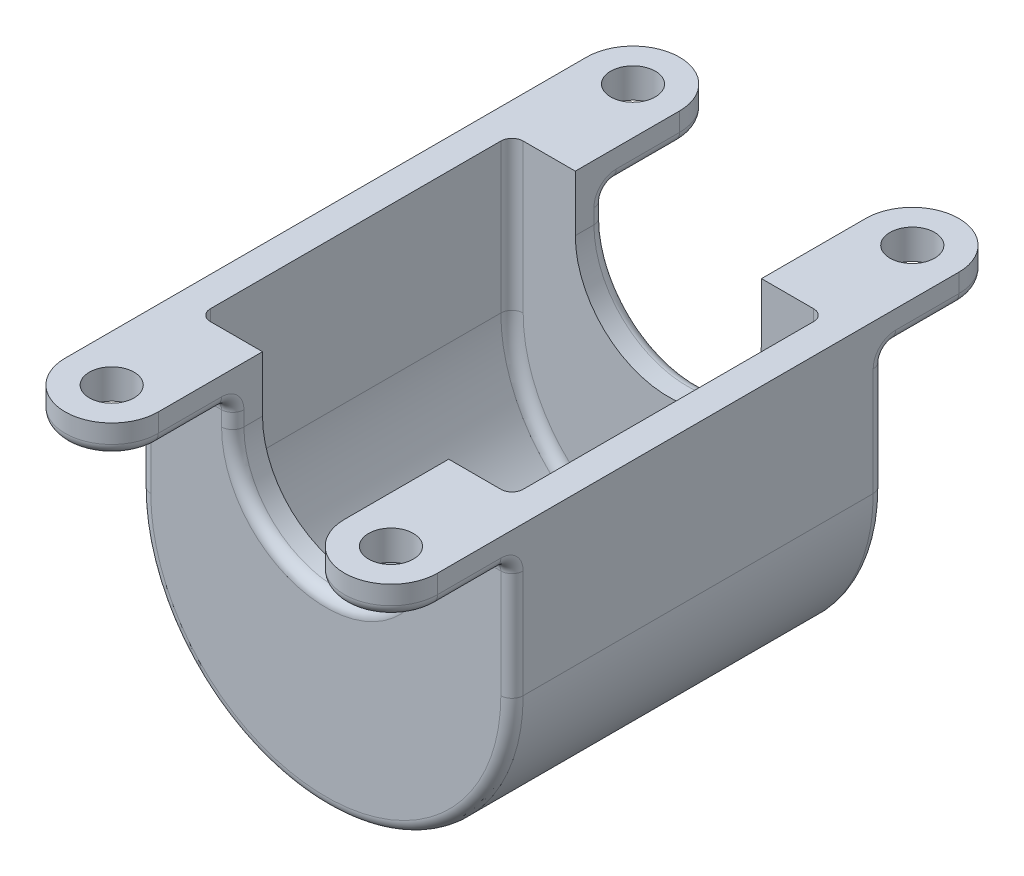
ISO-10303-21;
HEADER;
FILE_DESCRIPTION(('STEP AP214'),'2;1');
FILE_NAME('part.step','',(''),(''),'','','');
FILE_SCHEMA(('AUTOMOTIVE_DESIGN { 1 0 10303 214 1 1 1 1 }'));
ENDSEC;
DATA;
#1=APPLICATION_CONTEXT('core data for automotive mechanical design processes');
#2=APPLICATION_PROTOCOL_DEFINITION('international standard','automotive_design',2000,#1);
#3=PRODUCT_CONTEXT('',#1,'mechanical');
#4=PRODUCT('Part','Part','',(#3));
#5=PRODUCT_RELATED_PRODUCT_CATEGORY('part','',(#4));
#6=PRODUCT_DEFINITION_FORMATION('','',#4);
#7=PRODUCT_DEFINITION_CONTEXT('part definition',#1,'design');
#8=PRODUCT_DEFINITION('design','',#6,#7);
#9=PRODUCT_DEFINITION_SHAPE('','',#8);
#10=(LENGTH_UNIT() NAMED_UNIT(*) SI_UNIT(.MILLI.,.METRE.));
#11=(NAMED_UNIT(*) PLANE_ANGLE_UNIT() SI_UNIT($,.RADIAN.));
#12=(NAMED_UNIT(*) SI_UNIT($,.STERADIAN.) SOLID_ANGLE_UNIT());
#13=UNCERTAINTY_MEASURE_WITH_UNIT(LENGTH_MEASURE(1.E-05),#10,'distance_accuracy_value','');
#14=(GEOMETRIC_REPRESENTATION_CONTEXT(3) GLOBAL_UNCERTAINTY_ASSIGNED_CONTEXT((#13)) GLOBAL_UNIT_ASSIGNED_CONTEXT((#10,
#11,#12)) REPRESENTATION_CONTEXT('',''));
#15=CARTESIAN_POINT('',(0.,0.,0.));
#16=DIRECTION('',(0.,0.,1.));
#17=DIRECTION('',(1.,0.,0.));
#18=AXIS2_PLACEMENT_3D('',#15,#16,#17);
#19=CARTESIAN_POINT('',(0.,-40.,50.));
#20=DIRECTION('',(0.,0.,1.));
#21=DIRECTION('',(1.,0.,0.));
#22=AXIS2_PLACEMENT_3D('',#19,#20,#21);
#23=PLANE('',#22);
#24=CARTESIAN_POINT('',(0.,-15.,50.));
#25=DIRECTION('',(0.,0.,1.));
#26=DIRECTION('',(1.,0.,0.));
#27=AXIS2_PLACEMENT_3D('',#24,#25,#26);
#28=CIRCLE('',#27,28.);
#29=CARTESIAN_POINT('',(28.,-15.,50.));
#30=VERTEX_POINT('',#29);
#31=CARTESIAN_POINT('',(-28.,-15.,50.));
#32=VERTEX_POINT('',#31);
#33=EDGE_CURVE('E567',#30,#32,#28,.F.);
#34=ORIENTED_EDGE('',*,*,#33,.T.);
#35=DIRECTION('',(0.,-1.,0.));
#36=VECTOR('',#35,1.);
#37=CARTESIAN_POINT('',(-28.,-40.,50.));
#38=LINE('',#37,#36);
#39=CARTESIAN_POINT('',(-28.,-11.,50.));
#40=VERTEX_POINT('',#39);
#41=EDGE_CURVE('E575',#32,#40,#38,.F.);
#42=ORIENTED_EDGE('',*,*,#41,.T.);
#43=DIRECTION('',(-1.,0.,0.));
#44=VECTOR('',#43,1.);
#45=CARTESIAN_POINT('',(0.,-11.,50.));
#46=LINE('',#45,#44);
#47=CARTESIAN_POINT('',(-47.,-11.,50.));
#48=VERTEX_POINT('',#47);
#49=EDGE_CURVE('E513',#40,#48,#46,.T.);
#50=ORIENTED_EDGE('',*,*,#49,.T.);
#51=DIRECTION('',(0.,-1.,0.));
#52=VECTOR('',#51,1.);
#53=CARTESIAN_POINT('',(-47.,-40.,50.));
#54=LINE('',#53,#52);
#55=CARTESIAN_POINT('',(-47.,-40.,50.));
#56=VERTEX_POINT('',#55);
#57=EDGE_CURVE('E564',#48,#56,#54,.T.);
#58=ORIENTED_EDGE('',*,*,#57,.T.);
#59=CARTESIAN_POINT('',(0.,-40.,50.));
#60=DIRECTION('',(0.,0.,1.));
#61=DIRECTION('',(1.,0.,0.));
#62=AXIS2_PLACEMENT_3D('',#59,#60,#61);
#63=CIRCLE('',#62,47.);
#64=CARTESIAN_POINT('',(47.,-40.,50.));
#65=VERTEX_POINT('',#64);
#66=EDGE_CURVE('E561',#56,#65,#63,.T.);
#67=ORIENTED_EDGE('',*,*,#66,.T.);
#68=DIRECTION('',(0.,-1.,0.));
#69=VECTOR('',#68,1.);
#70=CARTESIAN_POINT('',(47.,-40.,50.));
#71=LINE('',#70,#69);
#72=CARTESIAN_POINT('',(47.,-11.,50.));
#73=VERTEX_POINT('',#72);
#74=EDGE_CURVE('E563',#65,#73,#71,.F.);
#75=ORIENTED_EDGE('',*,*,#74,.T.);
#76=DIRECTION('',(-1.,0.,0.));
#77=VECTOR('',#76,1.);
#78=CARTESIAN_POINT('',(0.,-11.,50.));
#79=LINE('',#78,#77);
#80=CARTESIAN_POINT('',(28.,-11.,50.));
#81=VERTEX_POINT('',#80);
#82=EDGE_CURVE('E517',#73,#81,#79,.T.);
#83=ORIENTED_EDGE('',*,*,#82,.T.);
#84=DIRECTION('',(0.,-1.,0.));
#85=VECTOR('',#84,1.);
#86=CARTESIAN_POINT('',(28.,-15.,50.));
#87=LINE('',#86,#85);
#88=EDGE_CURVE('E570',#81,#30,#87,.T.);
#89=ORIENTED_EDGE('',*,*,#88,.T.);
#90=EDGE_LOOP('',(#34,#42,#50,#58,#67,#75,#83,#89));
#91=FACE_BOUND('',#90,.T.);
#92=ADVANCED_FACE('F50',(#91),#23,.T.);
#93=CARTESIAN_POINT('',(-25.,0.,50.));
#94=DIRECTION('',(0.,-1.,0.));
#95=DIRECTION('',(1.,0.,0.));
#96=AXIS2_PLACEMENT_3D('',#93,#94,#95);
#97=PLANE('',#96);
#98=DIRECTION('',(-1.,0.,0.));
#99=VECTOR('',#98,1.);
#100=CARTESIAN_POINT('',(-25.,0.,42.));
#101=LINE('',#100,#99);
#102=CARTESIAN_POINT('',(-25.,0.,42.));
#103=VERTEX_POINT('',#102);
#104=CARTESIAN_POINT('',(-39.,0.,42.));
#105=VERTEX_POINT('',#104);
#106=EDGE_CURVE('E447',#103,#105,#101,.T.);
#107=ORIENTED_EDGE('',*,*,#106,.T.);
#108=CARTESIAN_POINT('',(-39.,0.,39.));
#109=DIRECTION('',(0.,-1.,0.));
#110=DIRECTION('',(1.,0.,0.));
#111=AXIS2_PLACEMENT_3D('',#108,#109,#110);
#112=CIRCLE('',#111,3.);
#113=CARTESIAN_POINT('',(-42.,0.,39.));
#114=VERTEX_POINT('',#113);
#115=EDGE_CURVE('E544',#105,#114,#112,.T.);
#116=ORIENTED_EDGE('',*,*,#115,.T.);
#117=DIRECTION('',(0.,0.,-1.));
#118=VECTOR('',#117,1.);
#119=CARTESIAN_POINT('',(-42.,0.,50.));
#120=LINE('',#119,#118);
#121=CARTESIAN_POINT('',(-42.,0.,-39.));
#122=VERTEX_POINT('',#121);
#123=EDGE_CURVE('E448',#114,#122,#120,.T.);
#124=ORIENTED_EDGE('',*,*,#123,.T.);
#125=CARTESIAN_POINT('',(-39.,0.,-39.));
#126=DIRECTION('',(0.,-1.,0.));
#127=DIRECTION('',(1.,0.,0.));
#128=AXIS2_PLACEMENT_3D('',#125,#126,#127);
#129=CIRCLE('',#128,3.);
#130=CARTESIAN_POINT('',(-39.,0.,-42.));
#131=VERTEX_POINT('',#130);
#132=EDGE_CURVE('E538',#122,#131,#129,.T.);
#133=ORIENTED_EDGE('',*,*,#132,.T.);
#134=DIRECTION('',(-1.,0.,0.));
#135=VECTOR('',#134,1.);
#136=CARTESIAN_POINT('',(-25.,0.,-42.));
#137=LINE('',#136,#135);
#138=CARTESIAN_POINT('',(-25.,0.,-42.));
#139=VERTEX_POINT('',#138);
#140=EDGE_CURVE('E399',#139,#131,#137,.T.);
#141=ORIENTED_EDGE('',*,*,#140,.F.);
#142=DIRECTION('',(0.,0.,1.));
#143=VECTOR('',#142,1.);
#144=CARTESIAN_POINT('',(-25.,0.,-50.));
#145=LINE('',#144,#143);
#146=CARTESIAN_POINT('',(-25.,0.,-70.));
#147=VERTEX_POINT('',#146);
#148=EDGE_CURVE('E406',#147,#139,#145,.T.);
#149=ORIENTED_EDGE('',*,*,#148,.F.);
#150=CARTESIAN_POINT('',(-37.5,0.,-70.));
#151=DIRECTION('',(0.,-1.,0.));
#152=DIRECTION('',(-1.,0.,0.));
#153=AXIS2_PLACEMENT_3D('',#150,#151,#152);
#154=CIRCLE('',#153,12.5);
#155=CARTESIAN_POINT('',(-50.,0.,-70.));
#156=VERTEX_POINT('',#155);
#157=EDGE_CURVE('E389',#156,#147,#154,.T.);
#158=ORIENTED_EDGE('',*,*,#157,.F.);
#159=DIRECTION('',(0.,0.,-1.));
#160=VECTOR('',#159,1.);
#161=CARTESIAN_POINT('',(-50.,0.,50.));
#162=LINE('',#161,#160);
#163=CARTESIAN_POINT('',(-50.,0.,70.));
#164=VERTEX_POINT('',#163);
#165=EDGE_CURVE('E488',#164,#156,#162,.T.);
#166=ORIENTED_EDGE('',*,*,#165,.F.);
#167=CARTESIAN_POINT('',(-37.5,0.,70.));
#168=DIRECTION('',(0.,1.,0.));
#169=DIRECTION('',(-1.,0.,0.));
#170=AXIS2_PLACEMENT_3D('',#167,#168,#169);
#171=CIRCLE('',#170,12.5);
#172=CARTESIAN_POINT('',(-25.,0.,70.));
#173=VERTEX_POINT('',#172);
#174=EDGE_CURVE('E440',#164,#173,#171,.T.);
#175=ORIENTED_EDGE('',*,*,#174,.T.);
#176=DIRECTION('',(0.,0.,-1.));
#177=VECTOR('',#176,1.);
#178=CARTESIAN_POINT('',(-25.,0.,50.));
#179=LINE('',#178,#177);
#180=EDGE_CURVE('E457',#173,#103,#179,.T.);
#181=ORIENTED_EDGE('',*,*,#180,.T.);
#182=EDGE_LOOP('',(#107,#116,#124,#133,#141,#149,#158,#166,#175,#181));
#183=FACE_BOUND('',#182,.T.);
#184=CARTESIAN_POINT('',(-37.5,0.,70.));
#185=DIRECTION('',(0.,1.,0.));
#186=DIRECTION('',(-1.,0.,0.));
#187=AXIS2_PLACEMENT_3D('',#184,#185,#186);
#188=CIRCLE('',#187,6.);
#189=CARTESIAN_POINT('',(-43.5,0.,70.));
#190=VERTEX_POINT('',#189);
#191=EDGE_CURVE('E433',#190,#190,#188,.T.);
#192=ORIENTED_EDGE('',*,*,#191,.F.);
#193=EDGE_LOOP('',(#192));
#194=FACE_BOUND('',#193,.T.);
#195=CARTESIAN_POINT('',(-37.5,0.,-70.));
#196=DIRECTION('',(0.,-1.,0.));
#197=DIRECTION('',(-1.,0.,0.));
#198=AXIS2_PLACEMENT_3D('',#195,#196,#197);
#199=CIRCLE('',#198,6.);
#200=CARTESIAN_POINT('',(-43.5,0.,-70.));
#201=VERTEX_POINT('',#200);
#202=EDGE_CURVE('E363',#201,#201,#199,.T.);
#203=ORIENTED_EDGE('',*,*,#202,.T.);
#204=EDGE_LOOP('',(#203));
#205=FACE_BOUND('',#204,.T.);
#206=ADVANCED_FACE('F926',(#183,#194,#205),#97,.F.);
#207=CARTESIAN_POINT('',(-50.,0.,50.));
#208=DIRECTION('',(1.,0.,0.));
#209=DIRECTION('',(0.,1.,0.));
#210=AXIS2_PLACEMENT_3D('',#207,#208,#209);
#211=PLANE('',#210);
#212=CARTESIAN_POINT('',(-50.,-11.,53.));
#213=DIRECTION('',(1.,0.,0.));
#214=DIRECTION('',(0.,1.,0.));
#215=AXIS2_PLACEMENT_3D('',#212,#213,#214);
#216=CIRCLE('',#215,6.);
#217=CARTESIAN_POINT('',(-50.,-11.,47.));
#218=VERTEX_POINT('',#217);
#219=CARTESIAN_POINT('',(-50.,-4.99999999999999,53.));
#220=VERTEX_POINT('',#219);
#221=EDGE_CURVE('E669',#218,#220,#216,.T.);
#222=ORIENTED_EDGE('',*,*,#221,.T.);
#223=DIRECTION('',(0.,0.,-1.));
#224=VECTOR('',#223,1.);
#225=CARTESIAN_POINT('',(-50.,-4.99999999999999,50.));
#226=LINE('',#225,#224);
#227=CARTESIAN_POINT('',(-50.,-4.99999999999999,70.));
#228=VERTEX_POINT('',#227);
#229=EDGE_CURVE('E672',#220,#228,#226,.F.);
#230=ORIENTED_EDGE('',*,*,#229,.T.);
#231=DIRECTION('',(0.,1.,0.));
#232=VECTOR('',#231,1.);
#233=CARTESIAN_POINT('',(-50.,-7.99999999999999,70.));
#234=LINE('',#233,#232);
#235=EDGE_CURVE('E445',#228,#164,#234,.T.);
#236=ORIENTED_EDGE('',*,*,#235,.T.);
#237=ORIENTED_EDGE('',*,*,#165,.T.);
#238=DIRECTION('',(0.,1.,0.));
#239=VECTOR('',#238,1.);
#240=CARTESIAN_POINT('',(-50.,-7.99999999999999,-70.));
#241=LINE('',#240,#239);
#242=CARTESIAN_POINT('',(-50.,-4.99999999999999,-70.));
#243=VERTEX_POINT('',#242);
#244=EDGE_CURVE('E395',#243,#156,#241,.T.);
#245=ORIENTED_EDGE('',*,*,#244,.F.);
#246=DIRECTION('',(0.,0.,1.));
#247=VECTOR('',#246,1.);
#248=CARTESIAN_POINT('',(-50.,-4.99999999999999,50.));
#249=LINE('',#248,#247);
#250=CARTESIAN_POINT('',(-50.,-4.99999999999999,-53.));
#251=VERTEX_POINT('',#250);
#252=EDGE_CURVE('E666',#243,#251,#249,.T.);
#253=ORIENTED_EDGE('',*,*,#252,.T.);
#254=CARTESIAN_POINT('',(-50.,-11.,-53.));
#255=DIRECTION('',(1.,0.,0.));
#256=DIRECTION('',(0.,1.,0.));
#257=AXIS2_PLACEMENT_3D('',#254,#255,#256);
#258=CIRCLE('',#257,6.);
#259=CARTESIAN_POINT('',(-50.,-11.,-47.));
#260=VERTEX_POINT('',#259);
#261=EDGE_CURVE('E664',#251,#260,#258,.T.);
#262=ORIENTED_EDGE('',*,*,#261,.T.);
#263=DIRECTION('',(0.,-1.,0.));
#264=VECTOR('',#263,1.);
#265=CARTESIAN_POINT('',(-50.,-40.,-47.));
#266=LINE('',#265,#264);
#267=CARTESIAN_POINT('',(-50.,-40.,-47.));
#268=VERTEX_POINT('',#267);
#269=EDGE_CURVE('E665',#260,#268,#266,.T.);
#270=ORIENTED_EDGE('',*,*,#269,.T.);
#271=DIRECTION('',(0.,0.,-1.));
#272=VECTOR('',#271,1.);
#273=CARTESIAN_POINT('',(-50.,-40.,50.));
#274=LINE('',#273,#272);
#275=CARTESIAN_POINT('',(-50.,-40.,47.));
#276=VERTEX_POINT('',#275);
#277=EDGE_CURVE('E483',#276,#268,#274,.T.);
#278=ORIENTED_EDGE('',*,*,#277,.F.);
#279=DIRECTION('',(0.,-1.,0.));
#280=VECTOR('',#279,1.);
#281=CARTESIAN_POINT('',(-50.,-11.,47.));
#282=LINE('',#281,#280);
#283=EDGE_CURVE('E667',#276,#218,#282,.F.);
#284=ORIENTED_EDGE('',*,*,#283,.T.);
#285=EDGE_LOOP('',(#222,#230,#236,#237,#245,#253,#262,#270,#278,#284));
#286=FACE_BOUND('',#285,.T.);
#287=ADVANCED_FACE('F829',(#286),#211,.F.);
#288=CARTESIAN_POINT('',(0.,-40.,50.));
#289=DIRECTION('',(0.,0.,-1.));
#290=DIRECTION('',(-1.,0.,0.));
#291=AXIS2_PLACEMENT_3D('',#288,#289,#290);
#292=CYLINDRICAL_SURFACE('',#291,50.);
#293=DIRECTION('',(0.,0.,-1.));
#294=VECTOR('',#293,1.);
#295=CARTESIAN_POINT('',(50.,-40.,50.));
#296=LINE('',#295,#294);
#297=CARTESIAN_POINT('',(50.,-40.,47.));
#298=VERTEX_POINT('',#297);
#299=CARTESIAN_POINT('',(50.,-40.,-47.));
#300=VERTEX_POINT('',#299);
#301=EDGE_CURVE('E373',#298,#300,#296,.T.);
#302=ORIENTED_EDGE('',*,*,#301,.F.);
#303=CARTESIAN_POINT('',(0.,-40.,47.));
#304=DIRECTION('',(0.,0.,1.));
#305=DIRECTION('',(1.,0.,0.));
#306=AXIS2_PLACEMENT_3D('',#303,#304,#305);
#307=CIRCLE('',#306,50.);
#308=EDGE_CURVE('E11',#298,#276,#307,.F.);
#309=ORIENTED_EDGE('',*,*,#308,.T.);
#310=ORIENTED_EDGE('',*,*,#277,.T.);
#311=CARTESIAN_POINT('',(0.,-40.,-47.));
#312=DIRECTION('',(0.,0.,-1.));
#313=DIRECTION('',(-1.,0.,0.));
#314=AXIS2_PLACEMENT_3D('',#311,#312,#313);
#315=CIRCLE('',#314,50.);
#316=EDGE_CURVE('E57',#268,#300,#315,.F.);
#317=ORIENTED_EDGE('',*,*,#316,.T.);
#318=EDGE_LOOP('',(#302,#309,#310,#317));
#319=FACE_BOUND('',#318,.T.);
#320=ADVANCED_FACE('F787',(#319),#292,.T.);
#321=CARTESIAN_POINT('',(50.,0.,50.));
#322=DIRECTION('',(1.,0.,0.));
#323=DIRECTION('',(0.,1.,0.));
#324=AXIS2_PLACEMENT_3D('',#321,#322,#323);
#325=PLANE('',#324);
#326=DIRECTION('',(0.,1.,0.));
#327=VECTOR('',#326,1.);
#328=CARTESIAN_POINT('',(50.,-7.99999999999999,70.));
#329=LINE('',#328,#327);
#330=CARTESIAN_POINT('',(50.,-4.99999999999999,70.));
#331=VERTEX_POINT('',#330);
#332=CARTESIAN_POINT('',(50.,0.,70.));
#333=VERTEX_POINT('',#332);
#334=EDGE_CURVE('E431',#331,#333,#329,.T.);
#335=ORIENTED_EDGE('',*,*,#334,.F.);
#336=DIRECTION('',(0.,0.,-1.));
#337=VECTOR('',#336,1.);
#338=CARTESIAN_POINT('',(50.,-4.99999999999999,53.));
#339=LINE('',#338,#337);
#340=CARTESIAN_POINT('',(50.,-4.99999999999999,53.));
#341=VERTEX_POINT('',#340);
#342=EDGE_CURVE('E63',#331,#341,#339,.T.);
#343=ORIENTED_EDGE('',*,*,#342,.T.);
#344=CARTESIAN_POINT('',(50.,-11.,53.));
#345=DIRECTION('',(1.,0.,0.));
#346=DIRECTION('',(0.,1.,0.));
#347=AXIS2_PLACEMENT_3D('',#344,#345,#346);
#348=CIRCLE('',#347,6.);
#349=CARTESIAN_POINT('',(50.,-11.,47.));
#350=VERTEX_POINT('',#349);
#351=EDGE_CURVE('E69',#341,#350,#348,.F.);
#352=ORIENTED_EDGE('',*,*,#351,.T.);
#353=DIRECTION('',(0.,-1.,0.));
#354=VECTOR('',#353,1.);
#355=CARTESIAN_POINT('',(50.,0.,47.));
#356=LINE('',#355,#354);
#357=EDGE_CURVE('E679',#350,#298,#356,.T.);
#358=ORIENTED_EDGE('',*,*,#357,.T.);
#359=ORIENTED_EDGE('',*,*,#301,.T.);
#360=DIRECTION('',(0.,-1.,0.));
#361=VECTOR('',#360,1.);
#362=CARTESIAN_POINT('',(50.,0.,-47.));
#363=LINE('',#362,#361);
#364=CARTESIAN_POINT('',(50.,-11.,-47.));
#365=VERTEX_POINT('',#364);
#366=EDGE_CURVE('E673',#300,#365,#363,.F.);
#367=ORIENTED_EDGE('',*,*,#366,.T.);
#368=CARTESIAN_POINT('',(50.,-11.,-53.));
#369=DIRECTION('',(1.,0.,0.));
#370=DIRECTION('',(0.,1.,0.));
#371=AXIS2_PLACEMENT_3D('',#368,#369,#370);
#372=CIRCLE('',#371,6.);
#373=CARTESIAN_POINT('',(50.,-4.99999999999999,-53.));
#374=VERTEX_POINT('',#373);
#375=EDGE_CURVE('E677',#365,#374,#372,.F.);
#376=ORIENTED_EDGE('',*,*,#375,.T.);
#377=DIRECTION('',(0.,0.,1.));
#378=VECTOR('',#377,1.);
#379=CARTESIAN_POINT('',(50.,-4.99999999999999,-70.));
#380=LINE('',#379,#378);
#381=CARTESIAN_POINT('',(50.,-4.99999999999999,-70.));
#382=VERTEX_POINT('',#381);
#383=EDGE_CURVE('E357',#374,#382,#380,.F.);
#384=ORIENTED_EDGE('',*,*,#383,.T.);
#385=DIRECTION('',(0.,1.,0.));
#386=VECTOR('',#385,1.);
#387=CARTESIAN_POINT('',(50.,-7.99999999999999,-70.));
#388=LINE('',#387,#386);
#389=CARTESIAN_POINT('',(50.,0.,-70.));
#390=VERTEX_POINT('',#389);
#391=EDGE_CURVE('E352',#382,#390,#388,.T.);
#392=ORIENTED_EDGE('',*,*,#391,.T.);
#393=DIRECTION('',(0.,0.,-1.));
#394=VECTOR('',#393,1.);
#395=CARTESIAN_POINT('',(50.,0.,50.));
#396=LINE('',#395,#394);
#397=EDGE_CURVE('E354',#333,#390,#396,.T.);
#398=ORIENTED_EDGE('',*,*,#397,.F.);
#399=EDGE_LOOP('',(#335,#343,#352,#358,#359,#367,#376,#384,#392,#398));
#400=FACE_BOUND('',#399,.T.);
#401=ADVANCED_FACE('F353',(#400),#325,.T.);
#402=CARTESIAN_POINT('',(50.,0.,50.));
#403=DIRECTION('',(0.,-1.,0.));
#404=DIRECTION('',(1.,0.,0.));
#405=AXIS2_PLACEMENT_3D('',#402,#403,#404);
#406=PLANE('',#405);
#407=ORIENTED_EDGE('',*,*,#397,.T.);
#408=CARTESIAN_POINT('',(37.5,0.,-70.));
#409=DIRECTION('',(0.,1.,0.));
#410=DIRECTION('',(1.,0.,0.));
#411=AXIS2_PLACEMENT_3D('',#408,#409,#410);
#412=CIRCLE('',#411,12.5);
#413=CARTESIAN_POINT('',(25.,0.,-70.));
#414=VERTEX_POINT('',#413);
#415=EDGE_CURVE('E367',#390,#414,#412,.T.);
#416=ORIENTED_EDGE('',*,*,#415,.T.);
#417=DIRECTION('',(0.,0.,1.));
#418=VECTOR('',#417,1.);
#419=CARTESIAN_POINT('',(25.,0.,-50.));
#420=LINE('',#419,#418);
#421=CARTESIAN_POINT('',(25.,0.,-42.));
#422=VERTEX_POINT('',#421);
#423=EDGE_CURVE('E416',#414,#422,#420,.T.);
#424=ORIENTED_EDGE('',*,*,#423,.T.);
#425=DIRECTION('',(-1.,0.,0.));
#426=VECTOR('',#425,1.);
#427=CARTESIAN_POINT('',(50.,0.,-42.));
#428=LINE('',#427,#426);
#429=CARTESIAN_POINT('',(39.,0.,-42.));
#430=VERTEX_POINT('',#429);
#431=EDGE_CURVE('E405',#430,#422,#428,.T.);
#432=ORIENTED_EDGE('',*,*,#431,.F.);
#433=CARTESIAN_POINT('',(39.,0.,-39.));
#434=DIRECTION('',(0.,-1.,0.));
#435=DIRECTION('',(1.,0.,0.));
#436=AXIS2_PLACEMENT_3D('',#433,#434,#435);
#437=CIRCLE('',#436,3.);
#438=CARTESIAN_POINT('',(42.,0.,-39.));
#439=VERTEX_POINT('',#438);
#440=EDGE_CURVE('E541',#430,#439,#437,.T.);
#441=ORIENTED_EDGE('',*,*,#440,.T.);
#442=DIRECTION('',(0.,0.,-1.));
#443=VECTOR('',#442,1.);
#444=CARTESIAN_POINT('',(42.,0.,50.));
#445=LINE('',#444,#443);
#446=CARTESIAN_POINT('',(42.,0.,39.));
#447=VERTEX_POINT('',#446);
#448=EDGE_CURVE('E453',#447,#439,#445,.T.);
#449=ORIENTED_EDGE('',*,*,#448,.F.);
#450=CARTESIAN_POINT('',(39.,0.,39.));
#451=DIRECTION('',(0.,-1.,0.));
#452=DIRECTION('',(1.,0.,0.));
#453=AXIS2_PLACEMENT_3D('',#450,#451,#452);
#454=CIRCLE('',#453,3.);
#455=CARTESIAN_POINT('',(39.,0.,42.));
#456=VERTEX_POINT('',#455);
#457=EDGE_CURVE('E545',#447,#456,#454,.T.);
#458=ORIENTED_EDGE('',*,*,#457,.T.);
#459=DIRECTION('',(-1.,0.,0.));
#460=VECTOR('',#459,1.);
#461=CARTESIAN_POINT('',(50.,0.,42.));
#462=LINE('',#461,#460);
#463=CARTESIAN_POINT('',(25.,0.,42.));
#464=VERTEX_POINT('',#463);
#465=EDGE_CURVE('E460',#456,#464,#462,.T.);
#466=ORIENTED_EDGE('',*,*,#465,.T.);
#467=DIRECTION('',(0.,0.,-1.));
#468=VECTOR('',#467,1.);
#469=CARTESIAN_POINT('',(25.,0.,50.));
#470=LINE('',#469,#468);
#471=CARTESIAN_POINT('',(25.,0.,70.));
#472=VERTEX_POINT('',#471);
#473=EDGE_CURVE('E372',#472,#464,#470,.T.);
#474=ORIENTED_EDGE('',*,*,#473,.F.);
#475=CARTESIAN_POINT('',(37.5,0.,70.));
#476=DIRECTION('',(0.,-1.,0.));
#477=DIRECTION('',(1.,0.,0.));
#478=AXIS2_PLACEMENT_3D('',#475,#476,#477);
#479=CIRCLE('',#478,12.5);
#480=EDGE_CURVE('E375',#333,#472,#479,.T.);
#481=ORIENTED_EDGE('',*,*,#480,.F.);
#482=EDGE_LOOP('',(#407,#416,#424,#432,#441,#449,#458,#466,#474,#481));
#483=FACE_BOUND('',#482,.T.);
#484=CARTESIAN_POINT('',(37.5,0.,70.));
#485=DIRECTION('',(0.,-1.,0.));
#486=DIRECTION('',(1.,0.,0.));
#487=AXIS2_PLACEMENT_3D('',#484,#485,#486);
#488=CIRCLE('',#487,6.);
#489=CARTESIAN_POINT('',(43.5,0.,70.));
#490=VERTEX_POINT('',#489);
#491=EDGE_CURVE('E422',#490,#490,#488,.T.);
#492=ORIENTED_EDGE('',*,*,#491,.T.);
#493=EDGE_LOOP('',(#492));
#494=FACE_BOUND('',#493,.T.);
#495=CARTESIAN_POINT('',(37.5,0.,-70.));
#496=DIRECTION('',(0.,1.,0.));
#497=DIRECTION('',(1.,0.,0.));
#498=AXIS2_PLACEMENT_3D('',#495,#496,#497);
#499=CIRCLE('',#498,6.);
#500=CARTESIAN_POINT('',(43.5,0.,-70.));
#501=VERTEX_POINT('',#500);
#502=EDGE_CURVE('E384',#501,#501,#499,.T.);
#503=ORIENTED_EDGE('',*,*,#502,.F.);
#504=EDGE_LOOP('',(#503));
#505=FACE_BOUND('',#504,.T.);
#506=ADVANCED_FACE('F366',(#483,#494,#505),#406,.F.);
#507=CARTESIAN_POINT('',(25.,0.,50.));
#508=DIRECTION('',(1.,0.,0.));
#509=DIRECTION('',(0.,1.,0.));
#510=AXIS2_PLACEMENT_3D('',#507,#508,#509);
#511=PLANE('',#510);
#512=DIRECTION('',(0.,0.,-1.));
#513=VECTOR('',#512,1.);
#514=CARTESIAN_POINT('',(25.,-15.,50.));
#515=LINE('',#514,#513);
#516=CARTESIAN_POINT('',(25.,-15.,47.));
#517=VERTEX_POINT('',#516);
#518=CARTESIAN_POINT('',(25.,-15.,42.));
#519=VERTEX_POINT('',#518);
#520=EDGE_CURVE('E477',#517,#519,#515,.T.);
#521=ORIENTED_EDGE('',*,*,#520,.F.);
#522=DIRECTION('',(0.,-1.,0.));
#523=VECTOR('',#522,1.);
#524=CARTESIAN_POINT('',(25.,-11.,47.));
#525=LINE('',#524,#523);
#526=CARTESIAN_POINT('',(25.,-11.,47.));
#527=VERTEX_POINT('',#526);
#528=EDGE_CURVE('E598',#517,#527,#525,.F.);
#529=ORIENTED_EDGE('',*,*,#528,.T.);
#530=CARTESIAN_POINT('',(25.,-11.,53.));
#531=DIRECTION('',(1.,0.,0.));
#532=DIRECTION('',(0.,1.,0.));
#533=AXIS2_PLACEMENT_3D('',#530,#531,#532);
#534=CIRCLE('',#533,6.);
#535=CARTESIAN_POINT('',(25.,-4.99999999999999,53.));
#536=VERTEX_POINT('',#535);
#537=EDGE_CURVE('E596',#527,#536,#534,.T.);
#538=ORIENTED_EDGE('',*,*,#537,.T.);
#539=DIRECTION('',(0.,0.,1.));
#540=VECTOR('',#539,1.);
#541=CARTESIAN_POINT('',(25.,-4.99999999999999,50.));
#542=LINE('',#541,#540);
#543=CARTESIAN_POINT('',(25.,-5.,70.));
#544=VERTEX_POINT('',#543);
#545=EDGE_CURVE('E597',#536,#544,#542,.T.);
#546=ORIENTED_EDGE('',*,*,#545,.T.);
#547=DIRECTION('',(0.,1.,0.));
#548=VECTOR('',#547,1.);
#549=CARTESIAN_POINT('',(25.,-8.,70.));
#550=LINE('',#549,#548);
#551=EDGE_CURVE('E429',#544,#472,#550,.T.);
#552=ORIENTED_EDGE('',*,*,#551,.T.);
#553=ORIENTED_EDGE('',*,*,#473,.T.);
#554=DIRECTION('',(0.,-1.,0.));
#555=VECTOR('',#554,1.);
#556=CARTESIAN_POINT('',(25.,0.,42.));
#557=LINE('',#556,#555);
#558=EDGE_CURVE('E470',#464,#519,#557,.T.);
#559=ORIENTED_EDGE('',*,*,#558,.T.);
#560=EDGE_LOOP('',(#521,#529,#538,#546,#552,#553,#559));
#561=FACE_BOUND('',#560,.T.);
#562=ADVANCED_FACE('F945',(#561),#511,.F.);
#563=CARTESIAN_POINT('',(0.,-15.,50.));
#564=DIRECTION('',(0.,0.,-1.));
#565=DIRECTION('',(-1.,0.,0.));
#566=AXIS2_PLACEMENT_3D('',#563,#564,#565);
#567=CYLINDRICAL_SURFACE('',#566,25.);
#568=DIRECTION('',(0.,0.,-1.));
#569=VECTOR('',#568,1.);
#570=CARTESIAN_POINT('',(-25.,-15.,50.));
#571=LINE('',#570,#569);
#572=CARTESIAN_POINT('',(-25.,-15.,47.));
#573=VERTEX_POINT('',#572);
#574=CARTESIAN_POINT('',(-25.,-15.,42.));
#575=VERTEX_POINT('',#574);
#576=EDGE_CURVE('E474',#573,#575,#571,.T.);
#577=ORIENTED_EDGE('',*,*,#576,.F.);
#578=CARTESIAN_POINT('',(0.,-15.,47.));
#579=DIRECTION('',(0.,0.,1.));
#580=DIRECTION('',(1.,0.,0.));
#581=AXIS2_PLACEMENT_3D('',#578,#579,#580);
#582=CIRCLE('',#581,25.);
#583=EDGE_CURVE('E550',#573,#517,#582,.T.);
#584=ORIENTED_EDGE('',*,*,#583,.T.);
#585=ORIENTED_EDGE('',*,*,#520,.T.);
#586=CARTESIAN_POINT('',(0.,-15.,42.));
#587=DIRECTION('',(0.,0.,1.));
#588=DIRECTION('',(1.,0.,0.));
#589=AXIS2_PLACEMENT_3D('',#586,#587,#588);
#590=CIRCLE('',#589,25.);
#591=EDGE_CURVE('E464',#575,#519,#590,.T.);
#592=ORIENTED_EDGE('',*,*,#591,.F.);
#593=EDGE_LOOP('',(#577,#584,#585,#592));
#594=FACE_BOUND('',#593,.T.);
#595=ADVANCED_FACE('F939',(#594),#567,.F.);
#596=CARTESIAN_POINT('',(-25.,0.,50.));
#597=DIRECTION('',(1.,0.,0.));
#598=DIRECTION('',(0.,1.,0.));
#599=AXIS2_PLACEMENT_3D('',#596,#597,#598);
#600=PLANE('',#599);
#601=CARTESIAN_POINT('',(-25.,-11.,53.));
#602=DIRECTION('',(1.,0.,0.));
#603=DIRECTION('',(0.,1.,0.));
#604=AXIS2_PLACEMENT_3D('',#601,#602,#603);
#605=CIRCLE('',#604,6.);
#606=CARTESIAN_POINT('',(-25.,-4.99999999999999,53.));
#607=VERTEX_POINT('',#606);
#608=CARTESIAN_POINT('',(-25.,-11.,47.));
#609=VERTEX_POINT('',#608);
#610=EDGE_CURVE('E595',#607,#609,#605,.F.);
#611=ORIENTED_EDGE('',*,*,#610,.T.);
#612=DIRECTION('',(0.,-1.,0.));
#613=VECTOR('',#612,1.);
#614=CARTESIAN_POINT('',(-25.,0.,47.));
#615=LINE('',#614,#613);
#616=EDGE_CURVE('E594',#609,#573,#615,.T.);
#617=ORIENTED_EDGE('',*,*,#616,.T.);
#618=ORIENTED_EDGE('',*,*,#576,.T.);
#619=DIRECTION('',(0.,-1.,0.));
#620=VECTOR('',#619,1.);
#621=CARTESIAN_POINT('',(-25.,0.,42.));
#622=LINE('',#621,#620);
#623=EDGE_CURVE('E462',#103,#575,#622,.T.);
#624=ORIENTED_EDGE('',*,*,#623,.F.);
#625=ORIENTED_EDGE('',*,*,#180,.F.);
#626=DIRECTION('',(0.,1.,0.));
#627=VECTOR('',#626,1.);
#628=CARTESIAN_POINT('',(-25.,-8.,70.));
#629=LINE('',#628,#627);
#630=CARTESIAN_POINT('',(-25.,-5.,70.));
#631=VERTEX_POINT('',#630);
#632=EDGE_CURVE('E443',#631,#173,#629,.T.);
#633=ORIENTED_EDGE('',*,*,#632,.F.);
#634=DIRECTION('',(0.,0.,1.));
#635=VECTOR('',#634,1.);
#636=CARTESIAN_POINT('',(-25.,-4.99999999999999,53.));
#637=LINE('',#636,#635);
#638=EDGE_CURVE('E590',#631,#607,#637,.F.);
#639=ORIENTED_EDGE('',*,*,#638,.T.);
#640=EDGE_LOOP('',(#611,#617,#618,#624,#625,#633,#639));
#641=FACE_BOUND('',#640,.T.);
#642=ADVANCED_FACE('F934',(#641),#600,.T.);
#643=CARTESIAN_POINT('',(-42.,0.,50.));
#644=DIRECTION('',(1.,0.,0.));
#645=DIRECTION('',(0.,1.,0.));
#646=AXIS2_PLACEMENT_3D('',#643,#644,#645);
#647=PLANE('',#646);
#648=DIRECTION('',(0.,0.,-1.));
#649=VECTOR('',#648,1.);
#650=CARTESIAN_POINT('',(-42.,-40.,50.));
#651=LINE('',#650,#649);
#652=CARTESIAN_POINT('',(-42.,-40.,39.));
#653=VERTEX_POINT('',#652);
#654=CARTESIAN_POINT('',(-42.,-40.,-39.));
#655=VERTEX_POINT('',#654);
#656=EDGE_CURVE('E450',#653,#655,#651,.T.);
#657=ORIENTED_EDGE('',*,*,#656,.T.);
#658=DIRECTION('',(0.,-1.,0.));
#659=VECTOR('',#658,1.);
#660=CARTESIAN_POINT('',(-42.,0.,-39.));
#661=LINE('',#660,#659);
#662=EDGE_CURVE('E497',#655,#122,#661,.F.);
#663=ORIENTED_EDGE('',*,*,#662,.T.);
#664=ORIENTED_EDGE('',*,*,#123,.F.);
#665=DIRECTION('',(0.,-1.,0.));
#666=VECTOR('',#665,1.);
#667=CARTESIAN_POINT('',(-42.,0.,39.));
#668=LINE('',#667,#666);
#669=EDGE_CURVE('E496',#114,#653,#668,.T.);
#670=ORIENTED_EDGE('',*,*,#669,.T.);
#671=EDGE_LOOP('',(#657,#663,#664,#670));
#672=FACE_BOUND('',#671,.T.);
#673=ADVANCED_FACE('F917',(#672),#647,.T.);
#674=CARTESIAN_POINT('',(0.,-40.,50.));
#675=DIRECTION('',(0.,0.,-1.));
#676=DIRECTION('',(-1.,0.,0.));
#677=AXIS2_PLACEMENT_3D('',#674,#675,#676);
#678=CYLINDRICAL_SURFACE('',#677,42.);
#679=DIRECTION('',(0.,0.,1.));
#680=VECTOR('',#679,1.);
#681=CARTESIAN_POINT('',(42.,-40.,50.));
#682=LINE('',#681,#680);
#683=CARTESIAN_POINT('',(42.,-40.,39.));
#684=VERTEX_POINT('',#683);
#685=CARTESIAN_POINT('',(42.,-40.,-39.));
#686=VERTEX_POINT('',#685);
#687=EDGE_CURVE('E451',#684,#686,#682,.F.);
#688=ORIENTED_EDGE('',*,*,#687,.T.);
#689=CARTESIAN_POINT('',(0.,-40.,-39.));
#690=DIRECTION('',(0.,0.,-1.));
#691=DIRECTION('',(-1.,0.,0.));
#692=AXIS2_PLACEMENT_3D('',#689,#690,#691);
#693=CIRCLE('',#692,42.);
#694=EDGE_CURVE('E514',#686,#655,#693,.T.);
#695=ORIENTED_EDGE('',*,*,#694,.T.);
#696=ORIENTED_EDGE('',*,*,#656,.F.);
#697=CARTESIAN_POINT('',(0.,-40.,39.));
#698=DIRECTION('',(0.,0.,1.));
#699=DIRECTION('',(1.,0.,0.));
#700=AXIS2_PLACEMENT_3D('',#697,#698,#699);
#701=CIRCLE('',#700,42.);
#702=EDGE_CURVE('E512',#653,#684,#701,.T.);
#703=ORIENTED_EDGE('',*,*,#702,.T.);
#704=EDGE_LOOP('',(#688,#695,#696,#703));
#705=FACE_BOUND('',#704,.T.);
#706=ADVANCED_FACE('F903',(#705),#678,.F.);
#707=CARTESIAN_POINT('',(42.,0.,50.));
#708=DIRECTION('',(1.,0.,0.));
#709=DIRECTION('',(0.,1.,0.));
#710=AXIS2_PLACEMENT_3D('',#707,#708,#709);
#711=PLANE('',#710);
#712=ORIENTED_EDGE('',*,*,#448,.T.);
#713=DIRECTION('',(0.,-1.,0.));
#714=VECTOR('',#713,1.);
#715=CARTESIAN_POINT('',(42.,-40.,-39.));
#716=LINE('',#715,#714);
#717=EDGE_CURVE('E503',#439,#686,#716,.T.);
#718=ORIENTED_EDGE('',*,*,#717,.T.);
#719=ORIENTED_EDGE('',*,*,#687,.F.);
#720=DIRECTION('',(0.,-1.,0.));
#721=VECTOR('',#720,1.);
#722=CARTESIAN_POINT('',(42.,0.,39.));
#723=LINE('',#722,#721);
#724=EDGE_CURVE('E501',#684,#447,#723,.F.);
#725=ORIENTED_EDGE('',*,*,#724,.T.);
#726=EDGE_LOOP('',(#712,#718,#719,#725));
#727=FACE_BOUND('',#726,.T.);
#728=ADVANCED_FACE('F905',(#727),#711,.F.);
#729=CARTESIAN_POINT('',(0.,-40.,42.));
#730=DIRECTION('',(0.,0.,1.));
#731=DIRECTION('',(1.,0.,0.));
#732=AXIS2_PLACEMENT_3D('',#729,#730,#731);
#733=PLANE('',#732);
#734=CARTESIAN_POINT('',(0.,-40.,42.));
#735=DIRECTION('',(0.,0.,1.));
#736=DIRECTION('',(1.,0.,0.));
#737=AXIS2_PLACEMENT_3D('',#734,#735,#736);
#738=CIRCLE('',#737,39.);
#739=CARTESIAN_POINT('',(39.,-40.,42.));
#740=VERTEX_POINT('',#739);
#741=CARTESIAN_POINT('',(-39.,-40.,42.));
#742=VERTEX_POINT('',#741);
#743=EDGE_CURVE('E504',#740,#742,#738,.F.);
#744=ORIENTED_EDGE('',*,*,#743,.T.);
#745=DIRECTION('',(0.,-1.,0.));
#746=VECTOR('',#745,1.);
#747=CARTESIAN_POINT('',(-39.,-40.,42.));
#748=LINE('',#747,#746);
#749=EDGE_CURVE('E508',#742,#105,#748,.F.);
#750=ORIENTED_EDGE('',*,*,#749,.T.);
#751=ORIENTED_EDGE('',*,*,#106,.F.);
#752=ORIENTED_EDGE('',*,*,#623,.T.);
#753=ORIENTED_EDGE('',*,*,#591,.T.);
#754=ORIENTED_EDGE('',*,*,#558,.F.);
#755=ORIENTED_EDGE('',*,*,#465,.F.);
#756=DIRECTION('',(0.,-1.,0.));
#757=VECTOR('',#756,1.);
#758=CARTESIAN_POINT('',(39.,-40.,42.));
#759=LINE('',#758,#757);
#760=EDGE_CURVE('E510',#456,#740,#759,.T.);
#761=ORIENTED_EDGE('',*,*,#760,.T.);
#762=EDGE_LOOP('',(#744,#750,#751,#752,#753,#754,#755,#761));
#763=FACE_BOUND('',#762,.T.);
#764=ADVANCED_FACE('F921',(#763),#733,.F.);
#765=CARTESIAN_POINT('',(-37.5,-7.99999999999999,70.));
#766=DIRECTION('',(0.,1.,0.));
#767=DIRECTION('',(-1.,0.,0.));
#768=AXIS2_PLACEMENT_3D('',#765,#766,#767);
#769=CYLINDRICAL_SURFACE('',#768,12.5);
#770=ORIENTED_EDGE('',*,*,#235,.F.);
#771=CARTESIAN_POINT('',(-37.5,-4.99999999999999,70.));
#772=DIRECTION('',(0.,1.,0.));
#773=DIRECTION('',(-1.,0.,0.));
#774=AXIS2_PLACEMENT_3D('',#771,#772,#773);
#775=CIRCLE('',#774,12.5);
#776=EDGE_CURVE('E653',#228,#631,#775,.T.);
#777=ORIENTED_EDGE('',*,*,#776,.T.);
#778=ORIENTED_EDGE('',*,*,#632,.T.);
#779=ORIENTED_EDGE('',*,*,#174,.F.);
#780=EDGE_LOOP('',(#770,#777,#778,#779));
#781=FACE_BOUND('',#780,.T.);
#782=ADVANCED_FACE('F1312',(#781),#769,.T.);
#783=CARTESIAN_POINT('',(-37.5,-7.99999999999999,70.));
#784=DIRECTION('',(0.,1.,0.));
#785=DIRECTION('',(-1.,0.,0.));
#786=AXIS2_PLACEMENT_3D('',#783,#784,#785);
#787=PLANE('',#786);
#788=DIRECTION('',(-1.,0.,0.));
#789=VECTOR('',#788,1.);
#790=CARTESIAN_POINT('',(-37.5,-7.99999999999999,53.));
#791=LINE('',#790,#789);
#792=CARTESIAN_POINT('',(-47.,-7.99999999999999,53.));
#793=VERTEX_POINT('',#792);
#794=CARTESIAN_POINT('',(-28.,-8.,53.));
#795=VERTEX_POINT('',#794);
#796=EDGE_CURVE('E523',#793,#795,#791,.F.);
#797=ORIENTED_EDGE('',*,*,#796,.T.);
#798=DIRECTION('',(0.,0.,1.));
#799=VECTOR('',#798,1.);
#800=CARTESIAN_POINT('',(-28.,-8.,70.));
#801=LINE('',#800,#799);
#802=CARTESIAN_POINT('',(-28.,-8.,70.));
#803=VERTEX_POINT('',#802);
#804=EDGE_CURVE('E632',#795,#803,#801,.T.);
#805=ORIENTED_EDGE('',*,*,#804,.T.);
#806=CARTESIAN_POINT('',(-37.5,-7.99999999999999,70.));
#807=DIRECTION('',(0.,1.,0.));
#808=DIRECTION('',(-1.,0.,0.));
#809=AXIS2_PLACEMENT_3D('',#806,#807,#808);
#810=CIRCLE('',#809,9.50000000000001);
#811=CARTESIAN_POINT('',(-47.,-7.99999999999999,70.));
#812=VERTEX_POINT('',#811);
#813=EDGE_CURVE('E635',#803,#812,#810,.F.);
#814=ORIENTED_EDGE('',*,*,#813,.T.);
#815=DIRECTION('',(0.,0.,-1.));
#816=VECTOR('',#815,1.);
#817=CARTESIAN_POINT('',(-47.,-7.99999999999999,70.));
#818=LINE('',#817,#816);
#819=EDGE_CURVE('E629',#812,#793,#818,.T.);
#820=ORIENTED_EDGE('',*,*,#819,.T.);
#821=EDGE_LOOP('',(#797,#805,#814,#820));
#822=FACE_BOUND('',#821,.T.);
#823=CARTESIAN_POINT('',(-37.5,-7.99999999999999,70.));
#824=DIRECTION('',(0.,1.,0.));
#825=DIRECTION('',(-1.,0.,0.));
#826=AXIS2_PLACEMENT_3D('',#823,#824,#825);
#827=CIRCLE('',#826,6.);
#828=CARTESIAN_POINT('',(-43.5,-7.99999999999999,70.));
#829=VERTEX_POINT('',#828);
#830=EDGE_CURVE('E432',#829,#829,#827,.T.);
#831=ORIENTED_EDGE('',*,*,#830,.T.);
#832=EDGE_LOOP('',(#831));
#833=FACE_BOUND('',#832,.T.);
#834=ADVANCED_FACE('F1307',(#822,#833),#787,.F.);
#835=CARTESIAN_POINT('',(-37.5,-7.99999999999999,70.));
#836=DIRECTION('',(0.,1.,0.));
#837=DIRECTION('',(-1.,0.,0.));
#838=AXIS2_PLACEMENT_3D('',#835,#836,#837);
#839=CYLINDRICAL_SURFACE('',#838,6.);
#840=ORIENTED_EDGE('',*,*,#830,.F.);
#841=EDGE_LOOP('',(#840));
#842=FACE_BOUND('',#841,.T.);
#843=ORIENTED_EDGE('',*,*,#191,.T.);
#844=EDGE_LOOP('',(#843));
#845=FACE_BOUND('',#844,.T.);
#846=ADVANCED_FACE('F1298',(#842,#845),#839,.F.);
#847=CARTESIAN_POINT('',(37.5,-7.99999999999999,70.));
#848=DIRECTION('',(0.,1.,0.));
#849=DIRECTION('',(1.,0.,0.));
#850=AXIS2_PLACEMENT_3D('',#847,#848,#849);
#851=PLANE('',#850);
#852=CARTESIAN_POINT('',(37.5,-7.99999999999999,70.));
#853=DIRECTION('',(0.,1.,0.));
#854=DIRECTION('',(-1.,0.,0.));
#855=AXIS2_PLACEMENT_3D('',#852,#853,#854);
#856=CIRCLE('',#855,9.50000000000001);
#857=CARTESIAN_POINT('',(47.,-7.99999999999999,70.));
#858=VERTEX_POINT('',#857);
#859=CARTESIAN_POINT('',(28.,-8.,70.));
#860=VERTEX_POINT('',#859);
#861=EDGE_CURVE('E637',#858,#860,#856,.F.);
#862=ORIENTED_EDGE('',*,*,#861,.T.);
#863=DIRECTION('',(0.,0.,1.));
#864=VECTOR('',#863,1.);
#865=CARTESIAN_POINT('',(28.,-8.,70.));
#866=LINE('',#865,#864);
#867=CARTESIAN_POINT('',(28.,-8.,53.));
#868=VERTEX_POINT('',#867);
#869=EDGE_CURVE('E639',#860,#868,#866,.F.);
#870=ORIENTED_EDGE('',*,*,#869,.T.);
#871=DIRECTION('',(-1.,0.,0.));
#872=VECTOR('',#871,1.);
#873=CARTESIAN_POINT('',(37.5,-7.99999999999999,53.));
#874=LINE('',#873,#872);
#875=CARTESIAN_POINT('',(47.,-7.99999999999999,53.));
#876=VERTEX_POINT('',#875);
#877=EDGE_CURVE('E521',#868,#876,#874,.F.);
#878=ORIENTED_EDGE('',*,*,#877,.T.);
#879=DIRECTION('',(0.,0.,-1.));
#880=VECTOR('',#879,1.);
#881=CARTESIAN_POINT('',(47.,-7.99999999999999,70.));
#882=LINE('',#881,#880);
#883=EDGE_CURVE('E636',#876,#858,#882,.F.);
#884=ORIENTED_EDGE('',*,*,#883,.T.);
#885=EDGE_LOOP('',(#862,#870,#878,#884));
#886=FACE_BOUND('',#885,.T.);
#887=CARTESIAN_POINT('',(37.5,-7.99999999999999,70.));
#888=DIRECTION('',(0.,-1.,0.));
#889=DIRECTION('',(1.,0.,0.));
#890=AXIS2_PLACEMENT_3D('',#887,#888,#889);
#891=CIRCLE('',#890,6.);
#892=CARTESIAN_POINT('',(43.5,-7.99999999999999,70.));
#893=VERTEX_POINT('',#892);
#894=EDGE_CURVE('E421',#893,#893,#891,.T.);
#895=ORIENTED_EDGE('',*,*,#894,.F.);
#896=EDGE_LOOP('',(#895));
#897=FACE_BOUND('',#896,.T.);
#898=ADVANCED_FACE('F807',(#886,#897),#851,.F.);
#899=CARTESIAN_POINT('',(37.5,-7.99999999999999,70.));
#900=DIRECTION('',(0.,1.,0.));
#901=DIRECTION('',(-1.,0.,0.));
#902=AXIS2_PLACEMENT_3D('',#899,#900,#901);
#903=CYLINDRICAL_SURFACE('',#902,12.5);
#904=ORIENTED_EDGE('',*,*,#551,.F.);
#905=CARTESIAN_POINT('',(37.5,-4.99999999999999,70.));
#906=DIRECTION('',(0.,1.,0.));
#907=DIRECTION('',(-1.,0.,0.));
#908=AXIS2_PLACEMENT_3D('',#905,#906,#907);
#909=CIRCLE('',#908,12.5);
#910=EDGE_CURVE('E657',#544,#331,#909,.T.);
#911=ORIENTED_EDGE('',*,*,#910,.T.);
#912=ORIENTED_EDGE('',*,*,#334,.T.);
#913=ORIENTED_EDGE('',*,*,#480,.T.);
#914=EDGE_LOOP('',(#904,#911,#912,#913));
#915=FACE_BOUND('',#914,.T.);
#916=ADVANCED_FACE('F1282',(#915),#903,.T.);
#917=CARTESIAN_POINT('',(37.5,-7.99999999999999,70.));
#918=DIRECTION('',(0.,1.,0.));
#919=DIRECTION('',(-1.,0.,0.));
#920=AXIS2_PLACEMENT_3D('',#917,#918,#919);
#921=CYLINDRICAL_SURFACE('',#920,6.);
#922=ORIENTED_EDGE('',*,*,#894,.T.);
#923=EDGE_LOOP('',(#922));
#924=FACE_BOUND('',#923,.T.);
#925=ORIENTED_EDGE('',*,*,#491,.F.);
#926=EDGE_LOOP('',(#925));
#927=FACE_BOUND('',#926,.T.);
#928=ADVANCED_FACE('F1276',(#924,#927),#921,.F.);
#929=CARTESIAN_POINT('',(0.,-40.,-50.));
#930=DIRECTION('',(0.,0.,-1.));
#931=DIRECTION('',(1.,0.,0.));
#932=AXIS2_PLACEMENT_3D('',#929,#930,#931);
#933=PLANE('',#932);
#934=DIRECTION('',(-1.,0.,0.));
#935=VECTOR('',#934,1.);
#936=CARTESIAN_POINT('',(0.,-11.,-50.));
#937=LINE('',#936,#935);
#938=CARTESIAN_POINT('',(-47.,-11.,-50.));
#939=VERTEX_POINT('',#938);
#940=CARTESIAN_POINT('',(-28.,-11.,-50.));
#941=VERTEX_POINT('',#940);
#942=EDGE_CURVE('E526',#939,#941,#937,.F.);
#943=ORIENTED_EDGE('',*,*,#942,.T.);
#944=DIRECTION('',(0.,-1.,0.));
#945=VECTOR('',#944,1.);
#946=CARTESIAN_POINT('',(-28.,-40.,-50.));
#947=LINE('',#946,#945);
#948=CARTESIAN_POINT('',(-28.,-15.,-50.));
#949=VERTEX_POINT('',#948);
#950=EDGE_CURVE('E584',#941,#949,#947,.T.);
#951=ORIENTED_EDGE('',*,*,#950,.T.);
#952=CARTESIAN_POINT('',(0.,-15.,-50.));
#953=DIRECTION('',(0.,0.,-1.));
#954=DIRECTION('',(-1.,0.,0.));
#955=AXIS2_PLACEMENT_3D('',#952,#953,#954);
#956=CIRCLE('',#955,28.);
#957=CARTESIAN_POINT('',(28.,-15.,-50.));
#958=VERTEX_POINT('',#957);
#959=EDGE_CURVE('E585',#949,#958,#956,.F.);
#960=ORIENTED_EDGE('',*,*,#959,.T.);
#961=DIRECTION('',(0.,-1.,0.));
#962=VECTOR('',#961,1.);
#963=CARTESIAN_POINT('',(28.,-11.,-50.));
#964=LINE('',#963,#962);
#965=CARTESIAN_POINT('',(28.,-11.,-50.));
#966=VERTEX_POINT('',#965);
#967=EDGE_CURVE('E578',#958,#966,#964,.F.);
#968=ORIENTED_EDGE('',*,*,#967,.T.);
#969=DIRECTION('',(-1.,0.,0.));
#970=VECTOR('',#969,1.);
#971=CARTESIAN_POINT('',(0.,-11.,-50.));
#972=LINE('',#971,#970);
#973=CARTESIAN_POINT('',(47.,-11.,-50.));
#974=VERTEX_POINT('',#973);
#975=EDGE_CURVE('E531',#966,#974,#972,.F.);
#976=ORIENTED_EDGE('',*,*,#975,.T.);
#977=DIRECTION('',(0.,-1.,0.));
#978=VECTOR('',#977,1.);
#979=CARTESIAN_POINT('',(47.,-40.,-50.));
#980=LINE('',#979,#978);
#981=CARTESIAN_POINT('',(47.,-40.,-50.));
#982=VERTEX_POINT('',#981);
#983=EDGE_CURVE('E577',#974,#982,#980,.T.);
#984=ORIENTED_EDGE('',*,*,#983,.T.);
#985=CARTESIAN_POINT('',(0.,-40.,-50.));
#986=DIRECTION('',(0.,0.,-1.));
#987=DIRECTION('',(-1.,0.,0.));
#988=AXIS2_PLACEMENT_3D('',#985,#986,#987);
#989=CIRCLE('',#988,47.);
#990=CARTESIAN_POINT('',(-47.,-40.,-50.));
#991=VERTEX_POINT('',#990);
#992=EDGE_CURVE('E573',#982,#991,#989,.T.);
#993=ORIENTED_EDGE('',*,*,#992,.T.);
#994=DIRECTION('',(0.,-1.,0.));
#995=VECTOR('',#994,1.);
#996=CARTESIAN_POINT('',(-47.,-11.,-50.));
#997=LINE('',#996,#995);
#998=EDGE_CURVE('E579',#991,#939,#997,.F.);
#999=ORIENTED_EDGE('',*,*,#998,.T.);
#1000=EDGE_LOOP('',(#943,#951,#960,#968,#976,#984,#993,#999));
#1001=FACE_BOUND('',#1000,.T.);
#1002=ADVANCED_FACE('F868',(#1001),#933,.T.);
#1003=CARTESIAN_POINT('',(25.,0.,-50.));
#1004=DIRECTION('',(1.,0.,0.));
#1005=DIRECTION('',(0.,1.,0.));
#1006=AXIS2_PLACEMENT_3D('',#1003,#1004,#1005);
#1007=PLANE('',#1006);
#1008=CARTESIAN_POINT('',(25.,-11.,-53.));
#1009=DIRECTION('',(1.,0.,0.));
#1010=DIRECTION('',(0.,1.,0.));
#1011=AXIS2_PLACEMENT_3D('',#1008,#1009,#1010);
#1012=CIRCLE('',#1011,6.);
#1013=CARTESIAN_POINT('',(25.,-4.99999999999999,-53.));
#1014=VERTEX_POINT('',#1013);
#1015=CARTESIAN_POINT('',(25.,-11.,-47.));
#1016=VERTEX_POINT('',#1015);
#1017=EDGE_CURVE('E610',#1014,#1016,#1012,.T.);
#1018=ORIENTED_EDGE('',*,*,#1017,.T.);
#1019=DIRECTION('',(0.,-1.,0.));
#1020=VECTOR('',#1019,1.);
#1021=CARTESIAN_POINT('',(25.,-15.,-47.));
#1022=LINE('',#1021,#1020);
#1023=CARTESIAN_POINT('',(25.,-15.,-47.));
#1024=VERTEX_POINT('',#1023);
#1025=EDGE_CURVE('E615',#1016,#1024,#1022,.T.);
#1026=ORIENTED_EDGE('',*,*,#1025,.T.);
#1027=DIRECTION('',(0.,0.,1.));
#1028=VECTOR('',#1027,1.);
#1029=CARTESIAN_POINT('',(25.,-15.,-50.));
#1030=LINE('',#1029,#1028);
#1031=CARTESIAN_POINT('',(25.,-15.,-42.));
#1032=VERTEX_POINT('',#1031);
#1033=EDGE_CURVE('E418',#1024,#1032,#1030,.T.);
#1034=ORIENTED_EDGE('',*,*,#1033,.T.);
#1035=DIRECTION('',(0.,-1.,0.));
#1036=VECTOR('',#1035,1.);
#1037=CARTESIAN_POINT('',(25.,0.,-42.));
#1038=LINE('',#1037,#1036);
#1039=EDGE_CURVE('E409',#422,#1032,#1038,.T.);
#1040=ORIENTED_EDGE('',*,*,#1039,.F.);
#1041=ORIENTED_EDGE('',*,*,#423,.F.);
#1042=DIRECTION('',(0.,1.,0.));
#1043=VECTOR('',#1042,1.);
#1044=CARTESIAN_POINT('',(25.,-8.,-70.));
#1045=LINE('',#1044,#1043);
#1046=CARTESIAN_POINT('',(25.,-5.,-70.));
#1047=VERTEX_POINT('',#1046);
#1048=EDGE_CURVE('E365',#1047,#414,#1045,.T.);
#1049=ORIENTED_EDGE('',*,*,#1048,.F.);
#1050=DIRECTION('',(0.,0.,-1.));
#1051=VECTOR('',#1050,1.);
#1052=CARTESIAN_POINT('',(25.,-4.99999999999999,-50.));
#1053=LINE('',#1052,#1051);
#1054=EDGE_CURVE('E609',#1047,#1014,#1053,.F.);
#1055=ORIENTED_EDGE('',*,*,#1054,.T.);
#1056=EDGE_LOOP('',(#1018,#1026,#1034,#1040,#1041,#1049,#1055));
#1057=FACE_BOUND('',#1056,.T.);
#1058=ADVANCED_FACE('F890',(#1057),#1007,.F.);
#1059=CARTESIAN_POINT('',(0.,-15.,-50.));
#1060=DIRECTION('',(0.,0.,1.));
#1061=DIRECTION('',(-1.,0.,0.));
#1062=AXIS2_PLACEMENT_3D('',#1059,#1060,#1061);
#1063=CYLINDRICAL_SURFACE('',#1062,25.);
#1064=ORIENTED_EDGE('',*,*,#1033,.F.);
#1065=CARTESIAN_POINT('',(0.,-15.,-47.));
#1066=DIRECTION('',(0.,0.,-1.));
#1067=DIRECTION('',(-1.,0.,0.));
#1068=AXIS2_PLACEMENT_3D('',#1065,#1066,#1067);
#1069=CIRCLE('',#1068,25.);
#1070=CARTESIAN_POINT('',(-25.,-15.,-47.));
#1071=VERTEX_POINT('',#1070);
#1072=EDGE_CURVE('E587',#1024,#1071,#1069,.T.);
#1073=ORIENTED_EDGE('',*,*,#1072,.T.);
#1074=DIRECTION('',(0.,0.,1.));
#1075=VECTOR('',#1074,1.);
#1076=CARTESIAN_POINT('',(-25.,-15.,-50.));
#1077=LINE('',#1076,#1075);
#1078=CARTESIAN_POINT('',(-25.,-15.,-42.));
#1079=VERTEX_POINT('',#1078);
#1080=EDGE_CURVE('E417',#1071,#1079,#1077,.T.);
#1081=ORIENTED_EDGE('',*,*,#1080,.T.);
#1082=CARTESIAN_POINT('',(0.,-15.,-42.));
#1083=DIRECTION('',(0.,0.,1.));
#1084=DIRECTION('',(1.,0.,0.));
#1085=AXIS2_PLACEMENT_3D('',#1082,#1083,#1084);
#1086=CIRCLE('',#1085,25.);
#1087=EDGE_CURVE('E410',#1079,#1032,#1086,.T.);
#1088=ORIENTED_EDGE('',*,*,#1087,.T.);
#1089=EDGE_LOOP('',(#1064,#1073,#1081,#1088));
#1090=FACE_BOUND('',#1089,.T.);
#1091=ADVANCED_FACE('F1247',(#1090),#1063,.F.);
#1092=CARTESIAN_POINT('',(-25.,0.,-50.));
#1093=DIRECTION('',(1.,0.,0.));
#1094=DIRECTION('',(0.,1.,0.));
#1095=AXIS2_PLACEMENT_3D('',#1092,#1093,#1094);
#1096=PLANE('',#1095);
#1097=ORIENTED_EDGE('',*,*,#1080,.F.);
#1098=DIRECTION('',(0.,-1.,0.));
#1099=VECTOR('',#1098,1.);
#1100=CARTESIAN_POINT('',(-25.,0.,-47.));
#1101=LINE('',#1100,#1099);
#1102=CARTESIAN_POINT('',(-25.,-11.,-47.));
#1103=VERTEX_POINT('',#1102);
#1104=EDGE_CURVE('E606',#1071,#1103,#1101,.F.);
#1105=ORIENTED_EDGE('',*,*,#1104,.T.);
#1106=CARTESIAN_POINT('',(-25.,-11.,-53.));
#1107=DIRECTION('',(1.,0.,0.));
#1108=DIRECTION('',(0.,1.,0.));
#1109=AXIS2_PLACEMENT_3D('',#1106,#1107,#1108);
#1110=CIRCLE('',#1109,6.);
#1111=CARTESIAN_POINT('',(-25.,-4.99999999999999,-53.));
#1112=VERTEX_POINT('',#1111);
#1113=EDGE_CURVE('E603',#1103,#1112,#1110,.F.);
#1114=ORIENTED_EDGE('',*,*,#1113,.T.);
#1115=DIRECTION('',(0.,0.,-1.));
#1116=VECTOR('',#1115,1.);
#1117=CARTESIAN_POINT('',(-25.,-4.99999999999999,-70.));
#1118=LINE('',#1117,#1116);
#1119=CARTESIAN_POINT('',(-25.,-5.,-70.));
#1120=VERTEX_POINT('',#1119);
#1121=EDGE_CURVE('E605',#1112,#1120,#1118,.T.);
#1122=ORIENTED_EDGE('',*,*,#1121,.T.);
#1123=DIRECTION('',(0.,1.,0.));
#1124=VECTOR('',#1123,1.);
#1125=CARTESIAN_POINT('',(-25.,-8.,-70.));
#1126=LINE('',#1125,#1124);
#1127=EDGE_CURVE('E400',#1120,#147,#1126,.T.);
#1128=ORIENTED_EDGE('',*,*,#1127,.T.);
#1129=ORIENTED_EDGE('',*,*,#148,.T.);
#1130=DIRECTION('',(0.,-1.,0.));
#1131=VECTOR('',#1130,1.);
#1132=CARTESIAN_POINT('',(-25.,0.,-42.));
#1133=LINE('',#1132,#1131);
#1134=EDGE_CURVE('E401',#139,#1079,#1133,.T.);
#1135=ORIENTED_EDGE('',*,*,#1134,.T.);
#1136=EDGE_LOOP('',(#1097,#1105,#1114,#1122,#1128,#1129,#1135));
#1137=FACE_BOUND('',#1136,.T.);
#1138=ADVANCED_FACE('F1242',(#1137),#1096,.T.);
#1139=CARTESIAN_POINT('',(0.,-40.,-42.));
#1140=DIRECTION('',(0.,0.,-1.));
#1141=DIRECTION('',(1.,0.,0.));
#1142=AXIS2_PLACEMENT_3D('',#1139,#1140,#1141);
#1143=PLANE('',#1142);
#1144=ORIENTED_EDGE('',*,*,#140,.T.);
#1145=DIRECTION('',(0.,-1.,0.));
#1146=VECTOR('',#1145,1.);
#1147=CARTESIAN_POINT('',(-39.,-40.,-42.));
#1148=LINE('',#1147,#1146);
#1149=CARTESIAN_POINT('',(-39.,-40.,-42.));
#1150=VERTEX_POINT('',#1149);
#1151=EDGE_CURVE('E491',#131,#1150,#1148,.T.);
#1152=ORIENTED_EDGE('',*,*,#1151,.T.);
#1153=CARTESIAN_POINT('',(0.,-40.,-42.));
#1154=DIRECTION('',(0.,0.,-1.));
#1155=DIRECTION('',(-1.,0.,0.));
#1156=AXIS2_PLACEMENT_3D('',#1153,#1154,#1155);
#1157=CIRCLE('',#1156,39.);
#1158=CARTESIAN_POINT('',(39.,-40.,-42.));
#1159=VERTEX_POINT('',#1158);
#1160=EDGE_CURVE('E490',#1150,#1159,#1157,.F.);
#1161=ORIENTED_EDGE('',*,*,#1160,.T.);
#1162=DIRECTION('',(0.,-1.,0.));
#1163=VECTOR('',#1162,1.);
#1164=CARTESIAN_POINT('',(39.,0.,-42.));
#1165=LINE('',#1164,#1163);
#1166=EDGE_CURVE('E493',#1159,#430,#1165,.F.);
#1167=ORIENTED_EDGE('',*,*,#1166,.T.);
#1168=ORIENTED_EDGE('',*,*,#431,.T.);
#1169=ORIENTED_EDGE('',*,*,#1039,.T.);
#1170=ORIENTED_EDGE('',*,*,#1087,.F.);
#1171=ORIENTED_EDGE('',*,*,#1134,.F.);
#1172=EDGE_LOOP('',(#1144,#1152,#1161,#1167,#1168,#1169,#1170,#1171));
#1173=FACE_BOUND('',#1172,.T.);
#1174=ADVANCED_FACE('F1235',(#1173),#1143,.F.);
#1175=CARTESIAN_POINT('',(-37.5,-7.99999999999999,-70.));
#1176=DIRECTION('',(0.,1.,0.));
#1177=DIRECTION('',(-1.,0.,0.));
#1178=AXIS2_PLACEMENT_3D('',#1175,#1176,#1177);
#1179=CYLINDRICAL_SURFACE('',#1178,12.5);
#1180=ORIENTED_EDGE('',*,*,#1127,.F.);
#1181=CARTESIAN_POINT('',(-37.5,-4.99999999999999,-70.));
#1182=DIRECTION('',(0.,1.,0.));
#1183=DIRECTION('',(-1.,0.,0.));
#1184=AXIS2_PLACEMENT_3D('',#1181,#1182,#1183);
#1185=CIRCLE('',#1184,12.5);
#1186=EDGE_CURVE('E658',#1120,#243,#1185,.T.);
#1187=ORIENTED_EDGE('',*,*,#1186,.T.);
#1188=ORIENTED_EDGE('',*,*,#244,.T.);
#1189=ORIENTED_EDGE('',*,*,#157,.T.);
#1190=EDGE_LOOP('',(#1180,#1187,#1188,#1189));
#1191=FACE_BOUND('',#1190,.T.);
#1192=ADVANCED_FACE('F1225',(#1191),#1179,.T.);
#1193=CARTESIAN_POINT('',(-37.5,-7.99999999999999,-70.));
#1194=DIRECTION('',(0.,1.,0.));
#1195=DIRECTION('',(-1.,0.,0.));
#1196=AXIS2_PLACEMENT_3D('',#1193,#1194,#1195);
#1197=PLANE('',#1196);
#1198=CARTESIAN_POINT('',(-37.5,-7.99999999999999,-70.));
#1199=DIRECTION('',(0.,1.,0.));
#1200=DIRECTION('',(-1.,0.,0.));
#1201=AXIS2_PLACEMENT_3D('',#1198,#1199,#1200);
#1202=CIRCLE('',#1201,9.50000000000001);
#1203=CARTESIAN_POINT('',(-47.,-7.99999999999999,-70.));
#1204=VERTEX_POINT('',#1203);
#1205=CARTESIAN_POINT('',(-28.,-8.,-70.));
#1206=VERTEX_POINT('',#1205);
#1207=EDGE_CURVE('E641',#1204,#1206,#1202,.F.);
#1208=ORIENTED_EDGE('',*,*,#1207,.T.);
#1209=DIRECTION('',(0.,0.,-1.));
#1210=VECTOR('',#1209,1.);
#1211=CARTESIAN_POINT('',(-28.,-8.,-53.));
#1212=LINE('',#1211,#1210);
#1213=CARTESIAN_POINT('',(-28.,-8.,-53.));
#1214=VERTEX_POINT('',#1213);
#1215=EDGE_CURVE('E646',#1206,#1214,#1212,.F.);
#1216=ORIENTED_EDGE('',*,*,#1215,.T.);
#1217=DIRECTION('',(-1.,0.,0.));
#1218=VECTOR('',#1217,1.);
#1219=CARTESIAN_POINT('',(-37.5,-7.99999999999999,-53.));
#1220=LINE('',#1219,#1218);
#1221=CARTESIAN_POINT('',(-47.,-7.99999999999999,-53.));
#1222=VERTEX_POINT('',#1221);
#1223=EDGE_CURVE('E536',#1214,#1222,#1220,.T.);
#1224=ORIENTED_EDGE('',*,*,#1223,.T.);
#1225=DIRECTION('',(0.,0.,1.));
#1226=VECTOR('',#1225,1.);
#1227=CARTESIAN_POINT('',(-47.,-7.99999999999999,-70.));
#1228=LINE('',#1227,#1226);
#1229=EDGE_CURVE('E645',#1222,#1204,#1228,.F.);
#1230=ORIENTED_EDGE('',*,*,#1229,.T.);
#1231=EDGE_LOOP('',(#1208,#1216,#1224,#1230));
#1232=FACE_BOUND('',#1231,.T.);
#1233=CARTESIAN_POINT('',(-37.5,-7.99999999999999,-70.));
#1234=DIRECTION('',(0.,-1.,0.));
#1235=DIRECTION('',(-1.,0.,0.));
#1236=AXIS2_PLACEMENT_3D('',#1233,#1234,#1235);
#1237=CIRCLE('',#1236,6.);
#1238=CARTESIAN_POINT('',(-43.5,-7.99999999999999,-70.));
#1239=VERTEX_POINT('',#1238);
#1240=EDGE_CURVE('E390',#1239,#1239,#1237,.T.);
#1241=ORIENTED_EDGE('',*,*,#1240,.F.);
#1242=EDGE_LOOP('',(#1241));
#1243=FACE_BOUND('',#1242,.T.);
#1244=ADVANCED_FACE('F844',(#1232,#1243),#1197,.F.);
#1245=CARTESIAN_POINT('',(-37.5,-7.99999999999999,-70.));
#1246=DIRECTION('',(0.,1.,0.));
#1247=DIRECTION('',(-1.,0.,0.));
#1248=AXIS2_PLACEMENT_3D('',#1245,#1246,#1247);
#1249=CYLINDRICAL_SURFACE('',#1248,6.);
#1250=ORIENTED_EDGE('',*,*,#1240,.T.);
#1251=EDGE_LOOP('',(#1250));
#1252=FACE_BOUND('',#1251,.T.);
#1253=ORIENTED_EDGE('',*,*,#202,.F.);
#1254=EDGE_LOOP('',(#1253));
#1255=FACE_BOUND('',#1254,.T.);
#1256=ADVANCED_FACE('F1209',(#1252,#1255),#1249,.F.);
#1257=CARTESIAN_POINT('',(37.5,-7.99999999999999,-70.));
#1258=DIRECTION('',(0.,1.,0.));
#1259=DIRECTION('',(1.,0.,0.));
#1260=AXIS2_PLACEMENT_3D('',#1257,#1258,#1259);
#1261=PLANE('',#1260);
#1262=DIRECTION('',(-1.,0.,0.));
#1263=VECTOR('',#1262,1.);
#1264=CARTESIAN_POINT('',(37.5,-7.99999999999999,-53.));
#1265=LINE('',#1264,#1263);
#1266=CARTESIAN_POINT('',(47.,-7.99999999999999,-53.));
#1267=VERTEX_POINT('',#1266);
#1268=CARTESIAN_POINT('',(28.,-8.,-53.));
#1269=VERTEX_POINT('',#1268);
#1270=EDGE_CURVE('E530',#1267,#1269,#1265,.T.);
#1271=ORIENTED_EDGE('',*,*,#1270,.T.);
#1272=DIRECTION('',(0.,0.,-1.));
#1273=VECTOR('',#1272,1.);
#1274=CARTESIAN_POINT('',(28.,-8.,-70.));
#1275=LINE('',#1274,#1273);
#1276=CARTESIAN_POINT('',(28.,-8.,-70.));
#1277=VERTEX_POINT('',#1276);
#1278=EDGE_CURVE('E652',#1269,#1277,#1275,.T.);
#1279=ORIENTED_EDGE('',*,*,#1278,.T.);
#1280=CARTESIAN_POINT('',(37.5,-7.99999999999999,-70.));
#1281=DIRECTION('',(0.,1.,0.));
#1282=DIRECTION('',(-1.,0.,0.));
#1283=AXIS2_PLACEMENT_3D('',#1280,#1281,#1282);
#1284=CIRCLE('',#1283,9.50000000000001);
#1285=CARTESIAN_POINT('',(47.,-7.99999999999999,-70.));
#1286=VERTEX_POINT('',#1285);
#1287=EDGE_CURVE('E649',#1277,#1286,#1284,.F.);
#1288=ORIENTED_EDGE('',*,*,#1287,.T.);
#1289=DIRECTION('',(0.,0.,1.));
#1290=VECTOR('',#1289,1.);
#1291=CARTESIAN_POINT('',(47.,-7.99999999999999,-53.));
#1292=LINE('',#1291,#1290);
#1293=EDGE_CURVE('E647',#1286,#1267,#1292,.T.);
#1294=ORIENTED_EDGE('',*,*,#1293,.T.);
#1295=EDGE_LOOP('',(#1271,#1279,#1288,#1294));
#1296=FACE_BOUND('',#1295,.T.);
#1297=CARTESIAN_POINT('',(37.5,-7.99999999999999,-70.));
#1298=DIRECTION('',(0.,1.,0.));
#1299=DIRECTION('',(1.,0.,0.));
#1300=AXIS2_PLACEMENT_3D('',#1297,#1298,#1299);
#1301=CIRCLE('',#1300,6.);
#1302=CARTESIAN_POINT('',(43.5,-7.99999999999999,-70.));
#1303=VERTEX_POINT('',#1302);
#1304=EDGE_CURVE('E378',#1303,#1303,#1301,.T.);
#1305=ORIENTED_EDGE('',*,*,#1304,.T.);
#1306=EDGE_LOOP('',(#1305));
#1307=FACE_BOUND('',#1306,.T.);
#1308=ADVANCED_FACE('F1200',(#1296,#1307),#1261,.F.);
#1309=CARTESIAN_POINT('',(37.5,-7.99999999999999,-70.));
#1310=DIRECTION('',(0.,1.,0.));
#1311=DIRECTION('',(-1.,0.,0.));
#1312=AXIS2_PLACEMENT_3D('',#1309,#1310,#1311);
#1313=CYLINDRICAL_SURFACE('',#1312,12.5);
#1314=ORIENTED_EDGE('',*,*,#391,.F.);
#1315=CARTESIAN_POINT('',(37.5,-4.99999999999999,-70.));
#1316=DIRECTION('',(0.,1.,0.));
#1317=DIRECTION('',(-1.,0.,0.));
#1318=AXIS2_PLACEMENT_3D('',#1315,#1316,#1317);
#1319=CIRCLE('',#1318,12.5);
#1320=EDGE_CURVE('E656',#382,#1047,#1319,.T.);
#1321=ORIENTED_EDGE('',*,*,#1320,.T.);
#1322=ORIENTED_EDGE('',*,*,#1048,.T.);
#1323=ORIENTED_EDGE('',*,*,#415,.F.);
#1324=EDGE_LOOP('',(#1314,#1321,#1322,#1323));
#1325=FACE_BOUND('',#1324,.T.);
#1326=ADVANCED_FACE('F376',(#1325),#1313,.T.);
#1327=CARTESIAN_POINT('',(37.5,-7.99999999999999,-70.));
#1328=DIRECTION('',(0.,1.,0.));
#1329=DIRECTION('',(-1.,0.,0.));
#1330=AXIS2_PLACEMENT_3D('',#1327,#1328,#1329);
#1331=CYLINDRICAL_SURFACE('',#1330,6.);
#1332=ORIENTED_EDGE('',*,*,#1304,.F.);
#1333=EDGE_LOOP('',(#1332));
#1334=FACE_BOUND('',#1333,.T.);
#1335=ORIENTED_EDGE('',*,*,#502,.T.);
#1336=EDGE_LOOP('',(#1335));
#1337=FACE_BOUND('',#1336,.T.);
#1338=ADVANCED_FACE('F988',(#1334,#1337),#1331,.F.);
#1339=CARTESIAN_POINT('',(39.,0.,-39.));
#1340=DIRECTION('',(0.,1.,0.));
#1341=DIRECTION('',(-1.,0.,0.));
#1342=AXIS2_PLACEMENT_3D('',#1339,#1340,#1341);
#1343=CYLINDRICAL_SURFACE('',#1342,3.);
#1344=ORIENTED_EDGE('',*,*,#440,.F.);
#1345=ORIENTED_EDGE('',*,*,#1166,.F.);
#1346=CARTESIAN_POINT('',(39.,-40.,-39.));
#1347=DIRECTION('',(0.,1.,0.));
#1348=DIRECTION('',(0.,0.,1.));
#1349=AXIS2_PLACEMENT_3D('',#1346,#1347,#1348);
#1350=CIRCLE('',#1349,3.);
#1351=EDGE_CURVE('E546',#686,#1159,#1350,.T.);
#1352=ORIENTED_EDGE('',*,*,#1351,.F.);
#1353=ORIENTED_EDGE('',*,*,#717,.F.);
#1354=EDGE_LOOP('',(#1344,#1345,#1352,#1353));
#1355=FACE_BOUND('',#1354,.T.);
#1356=ADVANCED_FACE('F900',(#1355),#1343,.F.);
#1357=CARTESIAN_POINT('',(0.,-40.,-39.));
#1358=DIRECTION('',(0.,0.,-1.));
#1359=DIRECTION('',(-1.,0.,0.));
#1360=AXIS2_PLACEMENT_3D('',#1357,#1358,#1359);
#1361=TOROIDAL_SURFACE('',#1360,39.,3.);
#1362=ORIENTED_EDGE('',*,*,#1351,.T.);
#1363=ORIENTED_EDGE('',*,*,#1160,.F.);
#1364=CARTESIAN_POINT('',(-39.,-40.,-39.));
#1365=DIRECTION('',(0.,-1.,0.));
#1366=DIRECTION('',(0.,0.,-1.));
#1367=AXIS2_PLACEMENT_3D('',#1364,#1365,#1366);
#1368=CIRCLE('',#1367,3.);
#1369=EDGE_CURVE('E548',#655,#1150,#1368,.T.);
#1370=ORIENTED_EDGE('',*,*,#1369,.F.);
#1371=ORIENTED_EDGE('',*,*,#694,.F.);
#1372=EDGE_LOOP('',(#1362,#1363,#1370,#1371));
#1373=FACE_BOUND('',#1372,.T.);
#1374=ADVANCED_FACE('F958',(#1373),#1361,.F.);
#1375=CARTESIAN_POINT('',(-39.,-40.,-39.));
#1376=DIRECTION('',(0.,-1.,0.));
#1377=DIRECTION('',(1.,0.,0.));
#1378=AXIS2_PLACEMENT_3D('',#1375,#1376,#1377);
#1379=CYLINDRICAL_SURFACE('',#1378,3.);
#1380=ORIENTED_EDGE('',*,*,#132,.F.);
#1381=ORIENTED_EDGE('',*,*,#662,.F.);
#1382=ORIENTED_EDGE('',*,*,#1369,.T.);
#1383=ORIENTED_EDGE('',*,*,#1151,.F.);
#1384=EDGE_LOOP('',(#1380,#1381,#1382,#1383));
#1385=FACE_BOUND('',#1384,.T.);
#1386=ADVANCED_FACE('F951',(#1385),#1379,.F.);
#1387=CARTESIAN_POINT('',(39.,-40.,39.));
#1388=DIRECTION('',(0.,1.,0.));
#1389=DIRECTION('',(-1.,0.,0.));
#1390=AXIS2_PLACEMENT_3D('',#1387,#1388,#1389);
#1391=CYLINDRICAL_SURFACE('',#1390,3.);
#1392=ORIENTED_EDGE('',*,*,#457,.F.);
#1393=ORIENTED_EDGE('',*,*,#724,.F.);
#1394=CARTESIAN_POINT('',(39.,-40.,39.));
#1395=DIRECTION('',(0.,1.,0.));
#1396=DIRECTION('',(0.,0.,1.));
#1397=AXIS2_PLACEMENT_3D('',#1394,#1395,#1396);
#1398=CIRCLE('',#1397,3.);
#1399=EDGE_CURVE('E553',#740,#684,#1398,.T.);
#1400=ORIENTED_EDGE('',*,*,#1399,.F.);
#1401=ORIENTED_EDGE('',*,*,#760,.F.);
#1402=EDGE_LOOP('',(#1392,#1393,#1400,#1401));
#1403=FACE_BOUND('',#1402,.T.);
#1404=ADVANCED_FACE('F949',(#1403),#1391,.F.);
#1405=CARTESIAN_POINT('',(0.,-40.,39.));
#1406=DIRECTION('',(0.,0.,1.));
#1407=DIRECTION('',(1.,0.,0.));
#1408=AXIS2_PLACEMENT_3D('',#1405,#1406,#1407);
#1409=TOROIDAL_SURFACE('',#1408,39.,3.);
#1410=ORIENTED_EDGE('',*,*,#1399,.T.);
#1411=ORIENTED_EDGE('',*,*,#702,.F.);
#1412=CARTESIAN_POINT('',(-39.,-40.,39.));
#1413=DIRECTION('',(0.,-1.,0.));
#1414=DIRECTION('',(0.,0.,-1.));
#1415=AXIS2_PLACEMENT_3D('',#1412,#1413,#1414);
#1416=CIRCLE('',#1415,3.);
#1417=EDGE_CURVE('E555',#742,#653,#1416,.T.);
#1418=ORIENTED_EDGE('',*,*,#1417,.F.);
#1419=ORIENTED_EDGE('',*,*,#743,.F.);
#1420=EDGE_LOOP('',(#1410,#1411,#1418,#1419));
#1421=FACE_BOUND('',#1420,.T.);
#1422=ADVANCED_FACE('F909',(#1421),#1409,.F.);
#1423=CARTESIAN_POINT('',(-39.,0.,39.));
#1424=DIRECTION('',(0.,-1.,0.));
#1425=DIRECTION('',(1.,0.,0.));
#1426=AXIS2_PLACEMENT_3D('',#1423,#1424,#1425);
#1427=CYLINDRICAL_SURFACE('',#1426,3.);
#1428=ORIENTED_EDGE('',*,*,#115,.F.);
#1429=ORIENTED_EDGE('',*,*,#749,.F.);
#1430=ORIENTED_EDGE('',*,*,#1417,.T.);
#1431=ORIENTED_EDGE('',*,*,#669,.F.);
#1432=EDGE_LOOP('',(#1428,#1429,#1430,#1431));
#1433=FACE_BOUND('',#1432,.T.);
#1434=ADVANCED_FACE('F916',(#1433),#1427,.F.);
#1435=CARTESIAN_POINT('',(0.,-11.,53.));
#1436=DIRECTION('',(-1.,0.,0.));
#1437=DIRECTION('',(0.,-1.,0.));
#1438=AXIS2_PLACEMENT_3D('',#1435,#1436,#1437);
#1439=CYLINDRICAL_SURFACE('',#1438,3.);
#1440=ORIENTED_EDGE('',*,*,#877,.F.);
#1441=CARTESIAN_POINT('',(28.,-11.,53.));
#1442=DIRECTION('',(1.,0.,0.));
#1443=DIRECTION('',(0.,1.,0.));
#1444=AXIS2_PLACEMENT_3D('',#1441,#1442,#1443);
#1445=CIRCLE('',#1444,3.);
#1446=EDGE_CURVE('E619',#868,#81,#1445,.F.);
#1447=ORIENTED_EDGE('',*,*,#1446,.T.);
#1448=ORIENTED_EDGE('',*,*,#82,.F.);
#1449=CARTESIAN_POINT('',(47.,-11.,53.));
#1450=DIRECTION('',(1.,0.,0.));
#1451=DIRECTION('',(0.,1.,0.));
#1452=AXIS2_PLACEMENT_3D('',#1449,#1450,#1451);
#1453=CIRCLE('',#1452,3.);
#1454=EDGE_CURVE('E616',#73,#876,#1453,.T.);
#1455=ORIENTED_EDGE('',*,*,#1454,.T.);
#1456=EDGE_LOOP('',(#1440,#1447,#1448,#1455));
#1457=FACE_BOUND('',#1456,.T.);
#1458=ADVANCED_FACE('F804',(#1457),#1439,.F.);
#1459=CARTESIAN_POINT('',(0.,-11.,53.));
#1460=DIRECTION('',(-1.,0.,0.));
#1461=DIRECTION('',(0.,-1.,0.));
#1462=AXIS2_PLACEMENT_3D('',#1459,#1460,#1461);
#1463=CYLINDRICAL_SURFACE('',#1462,3.);
#1464=ORIENTED_EDGE('',*,*,#49,.F.);
#1465=CARTESIAN_POINT('',(-28.,-11.,53.));
#1466=DIRECTION('',(1.,0.,0.));
#1467=DIRECTION('',(0.,1.,0.));
#1468=AXIS2_PLACEMENT_3D('',#1465,#1466,#1467);
#1469=CIRCLE('',#1468,3.);
#1470=EDGE_CURVE('E618',#40,#795,#1469,.T.);
#1471=ORIENTED_EDGE('',*,*,#1470,.T.);
#1472=ORIENTED_EDGE('',*,*,#796,.F.);
#1473=CARTESIAN_POINT('',(-47.,-11.,53.));
#1474=DIRECTION('',(1.,0.,0.));
#1475=DIRECTION('',(0.,1.,0.));
#1476=AXIS2_PLACEMENT_3D('',#1473,#1474,#1475);
#1477=CIRCLE('',#1476,3.);
#1478=EDGE_CURVE('E614',#793,#48,#1477,.F.);
#1479=ORIENTED_EDGE('',*,*,#1478,.T.);
#1480=EDGE_LOOP('',(#1464,#1471,#1472,#1479));
#1481=FACE_BOUND('',#1480,.T.);
#1482=ADVANCED_FACE('F994',(#1481),#1463,.F.);
#1483=CARTESIAN_POINT('',(37.5,-11.,-53.));
#1484=DIRECTION('',(-1.,0.,0.));
#1485=DIRECTION('',(0.,-1.,0.));
#1486=AXIS2_PLACEMENT_3D('',#1483,#1484,#1485);
#1487=CYLINDRICAL_SURFACE('',#1486,3.);
#1488=ORIENTED_EDGE('',*,*,#975,.F.);
#1489=CARTESIAN_POINT('',(28.,-11.,-53.));
#1490=DIRECTION('',(1.,0.,0.));
#1491=DIRECTION('',(0.,1.,0.));
#1492=AXIS2_PLACEMENT_3D('',#1489,#1490,#1491);
#1493=CIRCLE('',#1492,3.);
#1494=EDGE_CURVE('E628',#966,#1269,#1493,.F.);
#1495=ORIENTED_EDGE('',*,*,#1494,.T.);
#1496=ORIENTED_EDGE('',*,*,#1270,.F.);
#1497=CARTESIAN_POINT('',(47.,-11.,-53.));
#1498=DIRECTION('',(1.,0.,0.));
#1499=DIRECTION('',(0.,1.,0.));
#1500=AXIS2_PLACEMENT_3D('',#1497,#1498,#1499);
#1501=CIRCLE('',#1500,3.);
#1502=EDGE_CURVE('E626',#1267,#974,#1501,.T.);
#1503=ORIENTED_EDGE('',*,*,#1502,.T.);
#1504=EDGE_LOOP('',(#1488,#1495,#1496,#1503));
#1505=FACE_BOUND('',#1504,.T.);
#1506=ADVANCED_FACE('F998',(#1505),#1487,.F.);
#1507=CARTESIAN_POINT('',(-37.5,-11.,-53.));
#1508=DIRECTION('',(-1.,0.,0.));
#1509=DIRECTION('',(0.,-1.,0.));
#1510=AXIS2_PLACEMENT_3D('',#1507,#1508,#1509);
#1511=CYLINDRICAL_SURFACE('',#1510,3.);
#1512=ORIENTED_EDGE('',*,*,#1223,.F.);
#1513=CARTESIAN_POINT('',(-28.,-11.,-53.));
#1514=DIRECTION('',(1.,0.,0.));
#1515=DIRECTION('',(0.,1.,0.));
#1516=AXIS2_PLACEMENT_3D('',#1513,#1514,#1515);
#1517=CIRCLE('',#1516,3.);
#1518=EDGE_CURVE('E624',#1214,#941,#1517,.T.);
#1519=ORIENTED_EDGE('',*,*,#1518,.T.);
#1520=ORIENTED_EDGE('',*,*,#942,.F.);
#1521=CARTESIAN_POINT('',(-47.,-11.,-53.));
#1522=DIRECTION('',(1.,0.,0.));
#1523=DIRECTION('',(0.,1.,0.));
#1524=AXIS2_PLACEMENT_3D('',#1521,#1522,#1523);
#1525=CIRCLE('',#1524,3.);
#1526=EDGE_CURVE('E625',#939,#1222,#1525,.F.);
#1527=ORIENTED_EDGE('',*,*,#1526,.T.);
#1528=EDGE_LOOP('',(#1512,#1519,#1520,#1527));
#1529=FACE_BOUND('',#1528,.T.);
#1530=ADVANCED_FACE('F855',(#1529),#1511,.F.);
#1531=CARTESIAN_POINT('',(0.,-40.,47.));
#1532=DIRECTION('',(0.,0.,1.));
#1533=DIRECTION('',(1.,0.,0.));
#1534=AXIS2_PLACEMENT_3D('',#1531,#1532,#1533);
#1535=TOROIDAL_SURFACE('',#1534,47.,3.);
#1536=CARTESIAN_POINT('',(47.,-40.,47.));
#1537=DIRECTION('',(0.,1.,0.));
#1538=DIRECTION('',(0.,0.,1.));
#1539=AXIS2_PLACEMENT_3D('',#1536,#1537,#1538);
#1540=CIRCLE('',#1539,3.);
#1541=EDGE_CURVE('E724',#65,#298,#1540,.T.);
#1542=ORIENTED_EDGE('',*,*,#1541,.F.);
#1543=ORIENTED_EDGE('',*,*,#66,.F.);
#1544=CARTESIAN_POINT('',(-47.,-40.,47.));
#1545=DIRECTION('',(0.,1.,0.));
#1546=DIRECTION('',(0.,0.,1.));
#1547=AXIS2_PLACEMENT_3D('',#1544,#1545,#1546);
#1548=CIRCLE('',#1547,3.);
#1549=EDGE_CURVE('E558',#276,#56,#1548,.T.);
#1550=ORIENTED_EDGE('',*,*,#1549,.F.);
#1551=ORIENTED_EDGE('',*,*,#308,.F.);
#1552=EDGE_LOOP('',(#1542,#1543,#1550,#1551));
#1553=FACE_BOUND('',#1552,.T.);
#1554=ADVANCED_FACE('F830',(#1553),#1535,.T.);
#1555=CARTESIAN_POINT('',(-47.,-40.,47.));
#1556=DIRECTION('',(0.,1.,0.));
#1557=DIRECTION('',(-1.,0.,0.));
#1558=AXIS2_PLACEMENT_3D('',#1555,#1556,#1557);
#1559=CYLINDRICAL_SURFACE('',#1558,3.);
#1560=ORIENTED_EDGE('',*,*,#1549,.T.);
#1561=ORIENTED_EDGE('',*,*,#57,.F.);
#1562=CARTESIAN_POINT('',(-47.,-11.,47.));
#1563=DIRECTION('',(0.,1.,0.));
#1564=DIRECTION('',(-1.,0.,0.));
#1565=AXIS2_PLACEMENT_3D('',#1562,#1563,#1564);
#1566=CIRCLE('',#1565,3.);
#1567=EDGE_CURVE('E722',#218,#48,#1566,.T.);
#1568=ORIENTED_EDGE('',*,*,#1567,.F.);
#1569=ORIENTED_EDGE('',*,*,#283,.F.);
#1570=EDGE_LOOP('',(#1560,#1561,#1568,#1569));
#1571=FACE_BOUND('',#1570,.T.);
#1572=ADVANCED_FACE('F1056',(#1571),#1559,.T.);
#1573=CARTESIAN_POINT('',(47.,0.,47.));
#1574=DIRECTION('',(0.,-1.,0.));
#1575=DIRECTION('',(1.,0.,0.));
#1576=AXIS2_PLACEMENT_3D('',#1573,#1574,#1575);
#1577=CYLINDRICAL_SURFACE('',#1576,3.);
#1578=ORIENTED_EDGE('',*,*,#1541,.T.);
#1579=ORIENTED_EDGE('',*,*,#357,.F.);
#1580=CARTESIAN_POINT('',(47.,-11.,47.));
#1581=DIRECTION('',(0.,1.,0.));
#1582=DIRECTION('',(-1.,0.,0.));
#1583=AXIS2_PLACEMENT_3D('',#1580,#1581,#1582);
#1584=CIRCLE('',#1583,3.);
#1585=EDGE_CURVE('E719',#73,#350,#1584,.T.);
#1586=ORIENTED_EDGE('',*,*,#1585,.F.);
#1587=ORIENTED_EDGE('',*,*,#74,.F.);
#1588=EDGE_LOOP('',(#1578,#1579,#1586,#1587));
#1589=FACE_BOUND('',#1588,.T.);
#1590=ADVANCED_FACE('F795',(#1589),#1577,.T.);
#1591=CARTESIAN_POINT('',(-47.,-11.,53.));
#1592=DIRECTION('',(1.,0.,0.));
#1593=DIRECTION('',(0.,1.,0.));
#1594=AXIS2_PLACEMENT_3D('',#1591,#1592,#1593);
#1595=TOROIDAL_SURFACE('',#1594,6.,3.);
#1596=ORIENTED_EDGE('',*,*,#1567,.T.);
#1597=ORIENTED_EDGE('',*,*,#1478,.F.);
#1598=CARTESIAN_POINT('',(-47.,-4.99999999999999,53.));
#1599=DIRECTION('',(0.,0.,1.));
#1600=DIRECTION('',(1.,0.,0.));
#1601=AXIS2_PLACEMENT_3D('',#1598,#1599,#1600);
#1602=CIRCLE('',#1601,3.);
#1603=EDGE_CURVE('E714',#220,#793,#1602,.T.);
#1604=ORIENTED_EDGE('',*,*,#1603,.F.);
#1605=ORIENTED_EDGE('',*,*,#221,.F.);
#1606=EDGE_LOOP('',(#1596,#1597,#1604,#1605));
#1607=FACE_BOUND('',#1606,.T.);
#1608=ADVANCED_FACE('F1046',(#1607),#1595,.T.);
#1609=CARTESIAN_POINT('',(47.,-11.,53.));
#1610=DIRECTION('',(1.,0.,0.));
#1611=DIRECTION('',(0.,1.,0.));
#1612=AXIS2_PLACEMENT_3D('',#1609,#1610,#1611);
#1613=TOROIDAL_SURFACE('',#1612,6.,3.);
#1614=ORIENTED_EDGE('',*,*,#1585,.T.);
#1615=ORIENTED_EDGE('',*,*,#351,.F.);
#1616=CARTESIAN_POINT('',(47.,-4.99999999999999,53.));
#1617=DIRECTION('',(0.,0.,1.));
#1618=DIRECTION('',(1.,0.,0.));
#1619=AXIS2_PLACEMENT_3D('',#1616,#1617,#1618);
#1620=CIRCLE('',#1619,3.);
#1621=EDGE_CURVE('E715',#876,#341,#1620,.T.);
#1622=ORIENTED_EDGE('',*,*,#1621,.F.);
#1623=ORIENTED_EDGE('',*,*,#1454,.F.);
#1624=EDGE_LOOP('',(#1614,#1615,#1622,#1623));
#1625=FACE_BOUND('',#1624,.T.);
#1626=ADVANCED_FACE('F800',(#1625),#1613,.T.);
#1627=CARTESIAN_POINT('',(-47.,-4.99999999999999,70.));
#1628=DIRECTION('',(0.,0.,-1.));
#1629=DIRECTION('',(-1.,0.,0.));
#1630=AXIS2_PLACEMENT_3D('',#1627,#1628,#1629);
#1631=CYLINDRICAL_SURFACE('',#1630,3.);
#1632=ORIENTED_EDGE('',*,*,#1603,.T.);
#1633=ORIENTED_EDGE('',*,*,#819,.F.);
#1634=CARTESIAN_POINT('',(-47.,-4.99999999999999,70.));
#1635=DIRECTION('',(0.,0.,1.));
#1636=DIRECTION('',(1.,0.,0.));
#1637=AXIS2_PLACEMENT_3D('',#1634,#1635,#1636);
#1638=CIRCLE('',#1637,3.);
#1639=EDGE_CURVE('E706',#228,#812,#1638,.T.);
#1640=ORIENTED_EDGE('',*,*,#1639,.F.);
#1641=ORIENTED_EDGE('',*,*,#229,.F.);
#1642=EDGE_LOOP('',(#1632,#1633,#1640,#1641));
#1643=FACE_BOUND('',#1642,.T.);
#1644=ADVANCED_FACE('F1044',(#1643),#1631,.T.);
#1645=CARTESIAN_POINT('',(47.,-4.99999999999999,50.));
#1646=DIRECTION('',(0.,0.,1.));
#1647=DIRECTION('',(1.,0.,0.));
#1648=AXIS2_PLACEMENT_3D('',#1645,#1646,#1647);
#1649=CYLINDRICAL_SURFACE('',#1648,3.);
#1650=ORIENTED_EDGE('',*,*,#1621,.T.);
#1651=ORIENTED_EDGE('',*,*,#342,.F.);
#1652=CARTESIAN_POINT('',(47.,-4.99999999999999,70.));
#1653=DIRECTION('',(0.,0.,1.));
#1654=DIRECTION('',(1.,0.,0.));
#1655=AXIS2_PLACEMENT_3D('',#1652,#1653,#1654);
#1656=CIRCLE('',#1655,3.);
#1657=EDGE_CURVE('E707',#858,#331,#1656,.T.);
#1658=ORIENTED_EDGE('',*,*,#1657,.F.);
#1659=ORIENTED_EDGE('',*,*,#883,.F.);
#1660=EDGE_LOOP('',(#1650,#1651,#1658,#1659));
#1661=FACE_BOUND('',#1660,.T.);
#1662=ADVANCED_FACE('F1038',(#1661),#1649,.T.);
#1663=CARTESIAN_POINT('',(-37.5,-4.99999999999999,70.));
#1664=DIRECTION('',(0.,1.,0.));
#1665=DIRECTION('',(-1.,0.,0.));
#1666=AXIS2_PLACEMENT_3D('',#1663,#1664,#1665);
#1667=TOROIDAL_SURFACE('',#1666,9.50000000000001,3.);
#1668=ORIENTED_EDGE('',*,*,#1639,.T.);
#1669=ORIENTED_EDGE('',*,*,#813,.F.);
#1670=CARTESIAN_POINT('',(-28.,-5.,70.));
#1671=DIRECTION('',(0.,0.,-1.));
#1672=DIRECTION('',(-1.,0.,0.));
#1673=AXIS2_PLACEMENT_3D('',#1670,#1671,#1672);
#1674=CIRCLE('',#1673,3.);
#1675=EDGE_CURVE('E702',#631,#803,#1674,.T.);
#1676=ORIENTED_EDGE('',*,*,#1675,.F.);
#1677=ORIENTED_EDGE('',*,*,#776,.F.);
#1678=EDGE_LOOP('',(#1668,#1669,#1676,#1677));
#1679=FACE_BOUND('',#1678,.T.);
#1680=ADVANCED_FACE('F1033',(#1679),#1667,.T.);
#1681=CARTESIAN_POINT('',(37.5,-4.99999999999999,70.));
#1682=DIRECTION('',(0.,1.,0.));
#1683=DIRECTION('',(-1.,0.,0.));
#1684=AXIS2_PLACEMENT_3D('',#1681,#1682,#1683);
#1685=TOROIDAL_SURFACE('',#1684,9.50000000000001,3.);
#1686=ORIENTED_EDGE('',*,*,#1657,.T.);
#1687=ORIENTED_EDGE('',*,*,#910,.F.);
#1688=CARTESIAN_POINT('',(28.,-5.,70.));
#1689=DIRECTION('',(0.,0.,-1.));
#1690=DIRECTION('',(-1.,0.,0.));
#1691=AXIS2_PLACEMENT_3D('',#1688,#1689,#1690);
#1692=CIRCLE('',#1691,3.);
#1693=EDGE_CURVE('E699',#860,#544,#1692,.T.);
#1694=ORIENTED_EDGE('',*,*,#1693,.F.);
#1695=ORIENTED_EDGE('',*,*,#861,.F.);
#1696=EDGE_LOOP('',(#1686,#1687,#1694,#1695));
#1697=FACE_BOUND('',#1696,.T.);
#1698=ADVANCED_FACE('F1032',(#1697),#1685,.T.);
#1699=CARTESIAN_POINT('',(-28.,-5.,70.));
#1700=DIRECTION('',(0.,0.,-1.));
#1701=DIRECTION('',(-1.,0.,0.));
#1702=AXIS2_PLACEMENT_3D('',#1699,#1700,#1701);
#1703=CYLINDRICAL_SURFACE('',#1702,3.);
#1704=ORIENTED_EDGE('',*,*,#1675,.T.);
#1705=ORIENTED_EDGE('',*,*,#804,.F.);
#1706=CARTESIAN_POINT('',(-28.,-5.,53.));
#1707=DIRECTION('',(0.,0.,-1.));
#1708=DIRECTION('',(-1.,0.,0.));
#1709=AXIS2_PLACEMENT_3D('',#1706,#1707,#1708);
#1710=CIRCLE('',#1709,3.);
#1711=EDGE_CURVE('E700',#607,#795,#1710,.T.);
#1712=ORIENTED_EDGE('',*,*,#1711,.F.);
#1713=ORIENTED_EDGE('',*,*,#638,.F.);
#1714=EDGE_LOOP('',(#1704,#1705,#1712,#1713));
#1715=FACE_BOUND('',#1714,.T.);
#1716=ADVANCED_FACE('F1027',(#1715),#1703,.T.);
#1717=CARTESIAN_POINT('',(28.,-5.,50.));
#1718=DIRECTION('',(0.,0.,1.));
#1719=DIRECTION('',(1.,0.,0.));
#1720=AXIS2_PLACEMENT_3D('',#1717,#1718,#1719);
#1721=CYLINDRICAL_SURFACE('',#1720,3.);
#1722=ORIENTED_EDGE('',*,*,#1693,.T.);
#1723=ORIENTED_EDGE('',*,*,#545,.F.);
#1724=CARTESIAN_POINT('',(28.,-5.,53.));
#1725=DIRECTION('',(0.,0.,-1.));
#1726=DIRECTION('',(-1.,0.,0.));
#1727=AXIS2_PLACEMENT_3D('',#1724,#1725,#1726);
#1728=CIRCLE('',#1727,3.);
#1729=EDGE_CURVE('E692',#868,#536,#1728,.T.);
#1730=ORIENTED_EDGE('',*,*,#1729,.F.);
#1731=ORIENTED_EDGE('',*,*,#869,.F.);
#1732=EDGE_LOOP('',(#1722,#1723,#1730,#1731));
#1733=FACE_BOUND('',#1732,.T.);
#1734=ADVANCED_FACE('F811',(#1733),#1721,.T.);
#1735=CARTESIAN_POINT('',(-28.,-11.,53.));
#1736=DIRECTION('',(1.,0.,0.));
#1737=DIRECTION('',(0.,1.,0.));
#1738=AXIS2_PLACEMENT_3D('',#1735,#1736,#1737);
#1739=TOROIDAL_SURFACE('',#1738,6.,3.);
#1740=ORIENTED_EDGE('',*,*,#1711,.T.);
#1741=ORIENTED_EDGE('',*,*,#1470,.F.);
#1742=CARTESIAN_POINT('',(-28.,-11.,47.));
#1743=DIRECTION('',(0.,-1.,0.));
#1744=DIRECTION('',(0.,0.,-1.));
#1745=AXIS2_PLACEMENT_3D('',#1742,#1743,#1744);
#1746=CIRCLE('',#1745,3.);
#1747=EDGE_CURVE('E691',#609,#40,#1746,.T.);
#1748=ORIENTED_EDGE('',*,*,#1747,.F.);
#1749=ORIENTED_EDGE('',*,*,#610,.F.);
#1750=EDGE_LOOP('',(#1740,#1741,#1748,#1749));
#1751=FACE_BOUND('',#1750,.T.);
#1752=ADVANCED_FACE('F1025',(#1751),#1739,.T.);
#1753=CARTESIAN_POINT('',(28.,-11.,53.));
#1754=DIRECTION('',(1.,0.,0.));
#1755=DIRECTION('',(0.,1.,0.));
#1756=AXIS2_PLACEMENT_3D('',#1753,#1754,#1755);
#1757=TOROIDAL_SURFACE('',#1756,6.,3.);
#1758=ORIENTED_EDGE('',*,*,#1729,.T.);
#1759=ORIENTED_EDGE('',*,*,#537,.F.);
#1760=CARTESIAN_POINT('',(28.,-11.,47.));
#1761=DIRECTION('',(0.,-1.,0.));
#1762=DIRECTION('',(0.,0.,-1.));
#1763=AXIS2_PLACEMENT_3D('',#1760,#1761,#1762);
#1764=CIRCLE('',#1763,3.);
#1765=EDGE_CURVE('E686',#81,#527,#1764,.T.);
#1766=ORIENTED_EDGE('',*,*,#1765,.F.);
#1767=ORIENTED_EDGE('',*,*,#1446,.F.);
#1768=EDGE_LOOP('',(#1758,#1759,#1766,#1767));
#1769=FACE_BOUND('',#1768,.T.);
#1770=ADVANCED_FACE('F819',(#1769),#1757,.T.);
#1771=CARTESIAN_POINT('',(-28.,0.,47.));
#1772=DIRECTION('',(0.,-1.,0.));
#1773=DIRECTION('',(1.,0.,0.));
#1774=AXIS2_PLACEMENT_3D('',#1771,#1772,#1773);
#1775=CYLINDRICAL_SURFACE('',#1774,3.);
#1776=ORIENTED_EDGE('',*,*,#1747,.T.);
#1777=ORIENTED_EDGE('',*,*,#41,.F.);
#1778=CARTESIAN_POINT('',(-28.,-15.,47.));
#1779=DIRECTION('',(0.,-1.,0.));
#1780=DIRECTION('',(0.,0.,-1.));
#1781=AXIS2_PLACEMENT_3D('',#1778,#1779,#1780);
#1782=CIRCLE('',#1781,3.);
#1783=EDGE_CURVE('E688',#573,#32,#1782,.T.);
#1784=ORIENTED_EDGE('',*,*,#1783,.F.);
#1785=ORIENTED_EDGE('',*,*,#616,.F.);
#1786=EDGE_LOOP('',(#1776,#1777,#1784,#1785));
#1787=FACE_BOUND('',#1786,.T.);
#1788=ADVANCED_FACE('F1012',(#1787),#1775,.T.);
#1789=CARTESIAN_POINT('',(28.,-40.,47.));
#1790=DIRECTION('',(0.,1.,0.));
#1791=DIRECTION('',(-1.,0.,0.));
#1792=AXIS2_PLACEMENT_3D('',#1789,#1790,#1791);
#1793=CYLINDRICAL_SURFACE('',#1792,3.);
#1794=ORIENTED_EDGE('',*,*,#1765,.T.);
#1795=ORIENTED_EDGE('',*,*,#528,.F.);
#1796=CARTESIAN_POINT('',(28.,-15.,47.));
#1797=DIRECTION('',(0.,-1.,0.));
#1798=DIRECTION('',(0.,0.,-1.));
#1799=AXIS2_PLACEMENT_3D('',#1796,#1797,#1798);
#1800=CIRCLE('',#1799,3.);
#1801=EDGE_CURVE('E685',#30,#517,#1800,.T.);
#1802=ORIENTED_EDGE('',*,*,#1801,.F.);
#1803=ORIENTED_EDGE('',*,*,#88,.F.);
#1804=EDGE_LOOP('',(#1794,#1795,#1802,#1803));
#1805=FACE_BOUND('',#1804,.T.);
#1806=ADVANCED_FACE('F1013',(#1805),#1793,.T.);
#1807=CARTESIAN_POINT('',(0.,-15.,47.));
#1808=DIRECTION('',(0.,0.,1.));
#1809=DIRECTION('',(1.,0.,0.));
#1810=AXIS2_PLACEMENT_3D('',#1807,#1808,#1809);
#1811=TOROIDAL_SURFACE('',#1810,28.,3.);
#1812=ORIENTED_EDGE('',*,*,#1783,.T.);
#1813=ORIENTED_EDGE('',*,*,#33,.F.);
#1814=ORIENTED_EDGE('',*,*,#1801,.T.);
#1815=ORIENTED_EDGE('',*,*,#583,.F.);
#1816=EDGE_LOOP('',(#1812,#1813,#1814,#1815));
#1817=FACE_BOUND('',#1816,.T.);
#1818=ADVANCED_FACE('F1006',(#1817),#1811,.T.);
#1819=CARTESIAN_POINT('',(0.,-40.,-47.));
#1820=DIRECTION('',(0.,0.,-1.));
#1821=DIRECTION('',(-1.,0.,0.));
#1822=AXIS2_PLACEMENT_3D('',#1819,#1820,#1821);
#1823=TOROIDAL_SURFACE('',#1822,47.,3.);
#1824=CARTESIAN_POINT('',(47.,-40.,-47.));
#1825=DIRECTION('',(0.,1.,0.));
#1826=DIRECTION('',(0.,0.,1.));
#1827=AXIS2_PLACEMENT_3D('',#1824,#1825,#1826);
#1828=CIRCLE('',#1827,3.);
#1829=EDGE_CURVE('E767',#300,#982,#1828,.T.);
#1830=ORIENTED_EDGE('',*,*,#1829,.F.);
#1831=ORIENTED_EDGE('',*,*,#316,.F.);
#1832=CARTESIAN_POINT('',(-47.,-40.,-47.));
#1833=DIRECTION('',(0.,1.,0.));
#1834=DIRECTION('',(0.,0.,1.));
#1835=AXIS2_PLACEMENT_3D('',#1832,#1833,#1834);
#1836=CIRCLE('',#1835,3.);
#1837=EDGE_CURVE('E51',#991,#268,#1836,.T.);
#1838=ORIENTED_EDGE('',*,*,#1837,.F.);
#1839=ORIENTED_EDGE('',*,*,#992,.F.);
#1840=EDGE_LOOP('',(#1830,#1831,#1838,#1839));
#1841=FACE_BOUND('',#1840,.T.);
#1842=ADVANCED_FACE('F47',(#1841),#1823,.T.);
#1843=CARTESIAN_POINT('',(-47.,0.,-47.));
#1844=DIRECTION('',(0.,1.,0.));
#1845=DIRECTION('',(-1.,0.,0.));
#1846=AXIS2_PLACEMENT_3D('',#1843,#1844,#1845);
#1847=CYLINDRICAL_SURFACE('',#1846,3.);
#1848=ORIENTED_EDGE('',*,*,#1837,.T.);
#1849=ORIENTED_EDGE('',*,*,#269,.F.);
#1850=CARTESIAN_POINT('',(-47.,-11.,-47.));
#1851=DIRECTION('',(0.,1.,0.));
#1852=DIRECTION('',(-1.,0.,0.));
#1853=AXIS2_PLACEMENT_3D('',#1850,#1851,#1852);
#1854=CIRCLE('',#1853,3.);
#1855=EDGE_CURVE('E766',#939,#260,#1854,.T.);
#1856=ORIENTED_EDGE('',*,*,#1855,.F.);
#1857=ORIENTED_EDGE('',*,*,#998,.F.);
#1858=EDGE_LOOP('',(#1848,#1849,#1856,#1857));
#1859=FACE_BOUND('',#1858,.T.);
#1860=ADVANCED_FACE('F778',(#1859),#1847,.T.);
#1861=CARTESIAN_POINT('',(47.,-40.,-47.));
#1862=DIRECTION('',(0.,-1.,0.));
#1863=DIRECTION('',(1.,0.,0.));
#1864=AXIS2_PLACEMENT_3D('',#1861,#1862,#1863);
#1865=CYLINDRICAL_SURFACE('',#1864,3.);
#1866=ORIENTED_EDGE('',*,*,#1829,.T.);
#1867=ORIENTED_EDGE('',*,*,#983,.F.);
#1868=CARTESIAN_POINT('',(47.,-11.,-47.));
#1869=DIRECTION('',(0.,1.,0.));
#1870=DIRECTION('',(0.,0.,1.));
#1871=AXIS2_PLACEMENT_3D('',#1868,#1869,#1870);
#1872=CIRCLE('',#1871,3.);
#1873=EDGE_CURVE('E763',#365,#974,#1872,.T.);
#1874=ORIENTED_EDGE('',*,*,#1873,.F.);
#1875=ORIENTED_EDGE('',*,*,#366,.F.);
#1876=EDGE_LOOP('',(#1866,#1867,#1874,#1875));
#1877=FACE_BOUND('',#1876,.T.);
#1878=ADVANCED_FACE('F872',(#1877),#1865,.T.);
#1879=CARTESIAN_POINT('',(-47.,-11.,-53.));
#1880=DIRECTION('',(1.,0.,0.));
#1881=DIRECTION('',(0.,1.,0.));
#1882=AXIS2_PLACEMENT_3D('',#1879,#1880,#1881);
#1883=TOROIDAL_SURFACE('',#1882,6.,3.);
#1884=ORIENTED_EDGE('',*,*,#1855,.T.);
#1885=ORIENTED_EDGE('',*,*,#261,.F.);
#1886=CARTESIAN_POINT('',(-47.,-4.99999999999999,-53.));
#1887=DIRECTION('',(0.,0.,-1.));
#1888=DIRECTION('',(-1.,0.,0.));
#1889=AXIS2_PLACEMENT_3D('',#1886,#1887,#1888);
#1890=CIRCLE('',#1889,3.);
#1891=EDGE_CURVE('E759',#1222,#251,#1890,.T.);
#1892=ORIENTED_EDGE('',*,*,#1891,.F.);
#1893=ORIENTED_EDGE('',*,*,#1526,.F.);
#1894=EDGE_LOOP('',(#1884,#1885,#1892,#1893));
#1895=FACE_BOUND('',#1894,.T.);
#1896=ADVANCED_FACE('F840',(#1895),#1883,.T.);
#1897=CARTESIAN_POINT('',(47.,-11.,-53.));
#1898=DIRECTION('',(1.,0.,0.));
#1899=DIRECTION('',(0.,1.,0.));
#1900=AXIS2_PLACEMENT_3D('',#1897,#1898,#1899);
#1901=TOROIDAL_SURFACE('',#1900,6.,3.);
#1902=ORIENTED_EDGE('',*,*,#1873,.T.);
#1903=ORIENTED_EDGE('',*,*,#1502,.F.);
#1904=CARTESIAN_POINT('',(47.,-4.99999999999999,-53.));
#1905=DIRECTION('',(0.,0.,-1.));
#1906=DIRECTION('',(-1.,0.,0.));
#1907=AXIS2_PLACEMENT_3D('',#1904,#1905,#1906);
#1908=CIRCLE('',#1907,3.);
#1909=EDGE_CURVE('E760',#374,#1267,#1908,.T.);
#1910=ORIENTED_EDGE('',*,*,#1909,.F.);
#1911=ORIENTED_EDGE('',*,*,#375,.F.);
#1912=EDGE_LOOP('',(#1902,#1903,#1910,#1911));
#1913=FACE_BOUND('',#1912,.T.);
#1914=ADVANCED_FACE('F871',(#1913),#1901,.T.);
#1915=CARTESIAN_POINT('',(-47.,-4.99999999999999,50.));
#1916=DIRECTION('',(0.,0.,1.));
#1917=DIRECTION('',(1.,0.,0.));
#1918=AXIS2_PLACEMENT_3D('',#1915,#1916,#1917);
#1919=CYLINDRICAL_SURFACE('',#1918,3.);
#1920=ORIENTED_EDGE('',*,*,#1891,.T.);
#1921=ORIENTED_EDGE('',*,*,#252,.F.);
#1922=CARTESIAN_POINT('',(-47.,-4.99999999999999,-70.));
#1923=DIRECTION('',(0.,0.,-1.));
#1924=DIRECTION('',(-1.,0.,0.));
#1925=AXIS2_PLACEMENT_3D('',#1922,#1923,#1924);
#1926=CIRCLE('',#1925,3.);
#1927=EDGE_CURVE('E754',#1204,#243,#1926,.T.);
#1928=ORIENTED_EDGE('',*,*,#1927,.F.);
#1929=ORIENTED_EDGE('',*,*,#1229,.F.);
#1930=EDGE_LOOP('',(#1920,#1921,#1928,#1929));
#1931=FACE_BOUND('',#1930,.T.);
#1932=ADVANCED_FACE('F841',(#1931),#1919,.T.);
#1933=CARTESIAN_POINT('',(47.,-4.99999999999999,-70.));
#1934=DIRECTION('',(0.,0.,-1.));
#1935=DIRECTION('',(-1.,0.,0.));
#1936=AXIS2_PLACEMENT_3D('',#1933,#1934,#1935);
#1937=CYLINDRICAL_SURFACE('',#1936,3.);
#1938=ORIENTED_EDGE('',*,*,#1909,.T.);
#1939=ORIENTED_EDGE('',*,*,#1293,.F.);
#1940=CARTESIAN_POINT('',(47.,-4.99999999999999,-70.));
#1941=DIRECTION('',(0.,0.,-1.));
#1942=DIRECTION('',(-1.,0.,0.));
#1943=AXIS2_PLACEMENT_3D('',#1940,#1941,#1942);
#1944=CIRCLE('',#1943,3.);
#1945=EDGE_CURVE('E753',#382,#1286,#1944,.T.);
#1946=ORIENTED_EDGE('',*,*,#1945,.F.);
#1947=ORIENTED_EDGE('',*,*,#383,.F.);
#1948=EDGE_LOOP('',(#1938,#1939,#1946,#1947));
#1949=FACE_BOUND('',#1948,.T.);
#1950=ADVANCED_FACE('F880',(#1949),#1937,.T.);
#1951=CARTESIAN_POINT('',(-37.5,-4.99999999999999,-70.));
#1952=DIRECTION('',(0.,1.,0.));
#1953=DIRECTION('',(-1.,0.,0.));
#1954=AXIS2_PLACEMENT_3D('',#1951,#1952,#1953);
#1955=TOROIDAL_SURFACE('',#1954,9.50000000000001,3.);
#1956=ORIENTED_EDGE('',*,*,#1927,.T.);
#1957=ORIENTED_EDGE('',*,*,#1186,.F.);
#1958=CARTESIAN_POINT('',(-28.,-5.,-70.));
#1959=DIRECTION('',(0.,0.,1.));
#1960=DIRECTION('',(1.,0.,0.));
#1961=AXIS2_PLACEMENT_3D('',#1958,#1959,#1960);
#1962=CIRCLE('',#1961,3.);
#1963=EDGE_CURVE('E746',#1206,#1120,#1962,.T.);
#1964=ORIENTED_EDGE('',*,*,#1963,.F.);
#1965=ORIENTED_EDGE('',*,*,#1207,.F.);
#1966=EDGE_LOOP('',(#1956,#1957,#1964,#1965));
#1967=FACE_BOUND('',#1966,.T.);
#1968=ADVANCED_FACE('F1086',(#1967),#1955,.T.);
#1969=CARTESIAN_POINT('',(37.5,-4.99999999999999,-70.));
#1970=DIRECTION('',(0.,1.,0.));
#1971=DIRECTION('',(-1.,0.,0.));
#1972=AXIS2_PLACEMENT_3D('',#1969,#1970,#1971);
#1973=TOROIDAL_SURFACE('',#1972,9.50000000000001,3.);
#1974=ORIENTED_EDGE('',*,*,#1945,.T.);
#1975=ORIENTED_EDGE('',*,*,#1287,.F.);
#1976=CARTESIAN_POINT('',(28.,-5.,-70.));
#1977=DIRECTION('',(0.,0.,1.));
#1978=DIRECTION('',(1.,0.,0.));
#1979=AXIS2_PLACEMENT_3D('',#1976,#1977,#1978);
#1980=CIRCLE('',#1979,3.);
#1981=EDGE_CURVE('E741',#1047,#1277,#1980,.T.);
#1982=ORIENTED_EDGE('',*,*,#1981,.F.);
#1983=ORIENTED_EDGE('',*,*,#1320,.F.);
#1984=EDGE_LOOP('',(#1974,#1975,#1982,#1983));
#1985=FACE_BOUND('',#1984,.T.);
#1986=ADVANCED_FACE('F884',(#1985),#1973,.T.);
#1987=CARTESIAN_POINT('',(-28.,-5.,-50.));
#1988=DIRECTION('',(0.,0.,1.));
#1989=DIRECTION('',(1.,0.,0.));
#1990=AXIS2_PLACEMENT_3D('',#1987,#1988,#1989);
#1991=CYLINDRICAL_SURFACE('',#1990,3.);
#1992=ORIENTED_EDGE('',*,*,#1963,.T.);
#1993=ORIENTED_EDGE('',*,*,#1121,.F.);
#1994=CARTESIAN_POINT('',(-28.,-5.,-53.));
#1995=DIRECTION('',(0.,0.,1.));
#1996=DIRECTION('',(1.,0.,0.));
#1997=AXIS2_PLACEMENT_3D('',#1994,#1995,#1996);
#1998=CIRCLE('',#1997,3.);
#1999=EDGE_CURVE('E745',#1214,#1112,#1998,.T.);
#2000=ORIENTED_EDGE('',*,*,#1999,.F.);
#2001=ORIENTED_EDGE('',*,*,#1215,.F.);
#2002=EDGE_LOOP('',(#1992,#1993,#2000,#2001));
#2003=FACE_BOUND('',#2002,.T.);
#2004=ADVANCED_FACE('F860',(#2003),#1991,.T.);
#2005=CARTESIAN_POINT('',(28.,-5.,-70.));
#2006=DIRECTION('',(0.,0.,-1.));
#2007=DIRECTION('',(-1.,0.,0.));
#2008=AXIS2_PLACEMENT_3D('',#2005,#2006,#2007);
#2009=CYLINDRICAL_SURFACE('',#2008,3.);
#2010=ORIENTED_EDGE('',*,*,#1981,.T.);
#2011=ORIENTED_EDGE('',*,*,#1278,.F.);
#2012=CARTESIAN_POINT('',(28.,-5.,-53.));
#2013=DIRECTION('',(0.,0.,1.));
#2014=DIRECTION('',(1.,0.,0.));
#2015=AXIS2_PLACEMENT_3D('',#2012,#2013,#2014);
#2016=CIRCLE('',#2015,3.);
#2017=EDGE_CURVE('E738',#1014,#1269,#2016,.T.);
#2018=ORIENTED_EDGE('',*,*,#2017,.F.);
#2019=ORIENTED_EDGE('',*,*,#1054,.F.);
#2020=EDGE_LOOP('',(#2010,#2011,#2018,#2019));
#2021=FACE_BOUND('',#2020,.T.);
#2022=ADVANCED_FACE('F1076',(#2021),#2009,.T.);
#2023=CARTESIAN_POINT('',(-28.,-11.,-53.));
#2024=DIRECTION('',(1.,0.,0.));
#2025=DIRECTION('',(0.,1.,0.));
#2026=AXIS2_PLACEMENT_3D('',#2023,#2024,#2025);
#2027=TOROIDAL_SURFACE('',#2026,6.,3.);
#2028=ORIENTED_EDGE('',*,*,#1999,.T.);
#2029=ORIENTED_EDGE('',*,*,#1113,.F.);
#2030=CARTESIAN_POINT('',(-28.,-11.,-47.));
#2031=DIRECTION('',(0.,-1.,0.));
#2032=DIRECTION('',(0.,0.,-1.));
#2033=AXIS2_PLACEMENT_3D('',#2030,#2031,#2032);
#2034=CIRCLE('',#2033,3.);
#2035=EDGE_CURVE('E736',#941,#1103,#2034,.T.);
#2036=ORIENTED_EDGE('',*,*,#2035,.F.);
#2037=ORIENTED_EDGE('',*,*,#1518,.F.);
#2038=EDGE_LOOP('',(#2028,#2029,#2036,#2037));
#2039=FACE_BOUND('',#2038,.T.);
#2040=ADVANCED_FACE('F861',(#2039),#2027,.T.);
#2041=CARTESIAN_POINT('',(28.,-11.,-53.));
#2042=DIRECTION('',(1.,0.,0.));
#2043=DIRECTION('',(0.,1.,0.));
#2044=AXIS2_PLACEMENT_3D('',#2041,#2042,#2043);
#2045=TOROIDAL_SURFACE('',#2044,6.,3.);
#2046=ORIENTED_EDGE('',*,*,#2017,.T.);
#2047=ORIENTED_EDGE('',*,*,#1494,.F.);
#2048=CARTESIAN_POINT('',(28.,-11.,-47.));
#2049=DIRECTION('',(0.,-1.,0.));
#2050=DIRECTION('',(0.,0.,-1.));
#2051=AXIS2_PLACEMENT_3D('',#2048,#2049,#2050);
#2052=CIRCLE('',#2051,3.);
#2053=EDGE_CURVE('E732',#1016,#966,#2052,.T.);
#2054=ORIENTED_EDGE('',*,*,#2053,.F.);
#2055=ORIENTED_EDGE('',*,*,#1017,.F.);
#2056=EDGE_LOOP('',(#2046,#2047,#2054,#2055));
#2057=FACE_BOUND('',#2056,.T.);
#2058=ADVANCED_FACE('F1072',(#2057),#2045,.T.);
#2059=CARTESIAN_POINT('',(-28.,-40.,-47.));
#2060=DIRECTION('',(0.,-1.,0.));
#2061=DIRECTION('',(1.,0.,0.));
#2062=AXIS2_PLACEMENT_3D('',#2059,#2060,#2061);
#2063=CYLINDRICAL_SURFACE('',#2062,3.);
#2064=ORIENTED_EDGE('',*,*,#2035,.T.);
#2065=ORIENTED_EDGE('',*,*,#1104,.F.);
#2066=CARTESIAN_POINT('',(-28.,-15.,-47.));
#2067=DIRECTION('',(0.,-1.,0.));
#2068=DIRECTION('',(0.,0.,-1.));
#2069=AXIS2_PLACEMENT_3D('',#2066,#2067,#2068);
#2070=CIRCLE('',#2069,3.);
#2071=EDGE_CURVE('E731',#949,#1071,#2070,.T.);
#2072=ORIENTED_EDGE('',*,*,#2071,.F.);
#2073=ORIENTED_EDGE('',*,*,#950,.F.);
#2074=EDGE_LOOP('',(#2064,#2065,#2072,#2073));
#2075=FACE_BOUND('',#2074,.T.);
#2076=ADVANCED_FACE('F866',(#2075),#2063,.T.);
#2077=CARTESIAN_POINT('',(28.,0.,-47.));
#2078=DIRECTION('',(0.,1.,0.));
#2079=DIRECTION('',(-1.,0.,0.));
#2080=AXIS2_PLACEMENT_3D('',#2077,#2078,#2079);
#2081=CYLINDRICAL_SURFACE('',#2080,3.);
#2082=ORIENTED_EDGE('',*,*,#2053,.T.);
#2083=ORIENTED_EDGE('',*,*,#967,.F.);
#2084=CARTESIAN_POINT('',(28.,-15.,-47.));
#2085=DIRECTION('',(0.,-1.,0.));
#2086=DIRECTION('',(0.,0.,-1.));
#2087=AXIS2_PLACEMENT_3D('',#2084,#2085,#2086);
#2088=CIRCLE('',#2087,3.);
#2089=EDGE_CURVE('E729',#1024,#958,#2088,.T.);
#2090=ORIENTED_EDGE('',*,*,#2089,.F.);
#2091=ORIENTED_EDGE('',*,*,#1025,.F.);
#2092=EDGE_LOOP('',(#2082,#2083,#2090,#2091));
#2093=FACE_BOUND('',#2092,.T.);
#2094=ADVANCED_FACE('F1065',(#2093),#2081,.T.);
#2095=CARTESIAN_POINT('',(0.,-15.,-47.));
#2096=DIRECTION('',(0.,0.,-1.));
#2097=DIRECTION('',(-1.,0.,0.));
#2098=AXIS2_PLACEMENT_3D('',#2095,#2096,#2097);
#2099=TOROIDAL_SURFACE('',#2098,28.,3.);
#2100=ORIENTED_EDGE('',*,*,#2071,.T.);
#2101=ORIENTED_EDGE('',*,*,#1072,.F.);
#2102=ORIENTED_EDGE('',*,*,#2089,.T.);
#2103=ORIENTED_EDGE('',*,*,#959,.F.);
#2104=EDGE_LOOP('',(#2100,#2101,#2102,#2103));
#2105=FACE_BOUND('',#2104,.T.);
#2106=ADVANCED_FACE('F1062',(#2105),#2099,.T.);
#2107=CLOSED_SHELL('',(#92,#206,#287,#320,#401,#506,#562,#595,#642,#673,#706,#728,#764,#782,
#834,#846,#898,#916,#928,#1002,#1058,#1091,#1138,#1174,#1192,#1244,#1256,#1308,#1326,#1338,
#1356,#1374,#1386,#1404,#1422,#1434,#1458,#1482,#1506,#1530,#1554,#1572,#1590,#1608,#1626,#1644,
#1662,#1680,#1698,#1716,#1734,#1752,#1770,#1788,#1806,#1818,#1842,#1860,#1878,#1896,#1914,#1932,
#1950,#1968,#1986,#2004,#2022,#2040,#2058,#2076,#2094,#2106));
#2108=MANIFOLD_SOLID_BREP('B2',#2107);
#2109=ADVANCED_BREP_SHAPE_REPRESENTATION('',(#18,#2108),#14);
#2110=SHAPE_DEFINITION_REPRESENTATION(#9,#2109);
ENDSEC;
END-ISO-10303-21;
